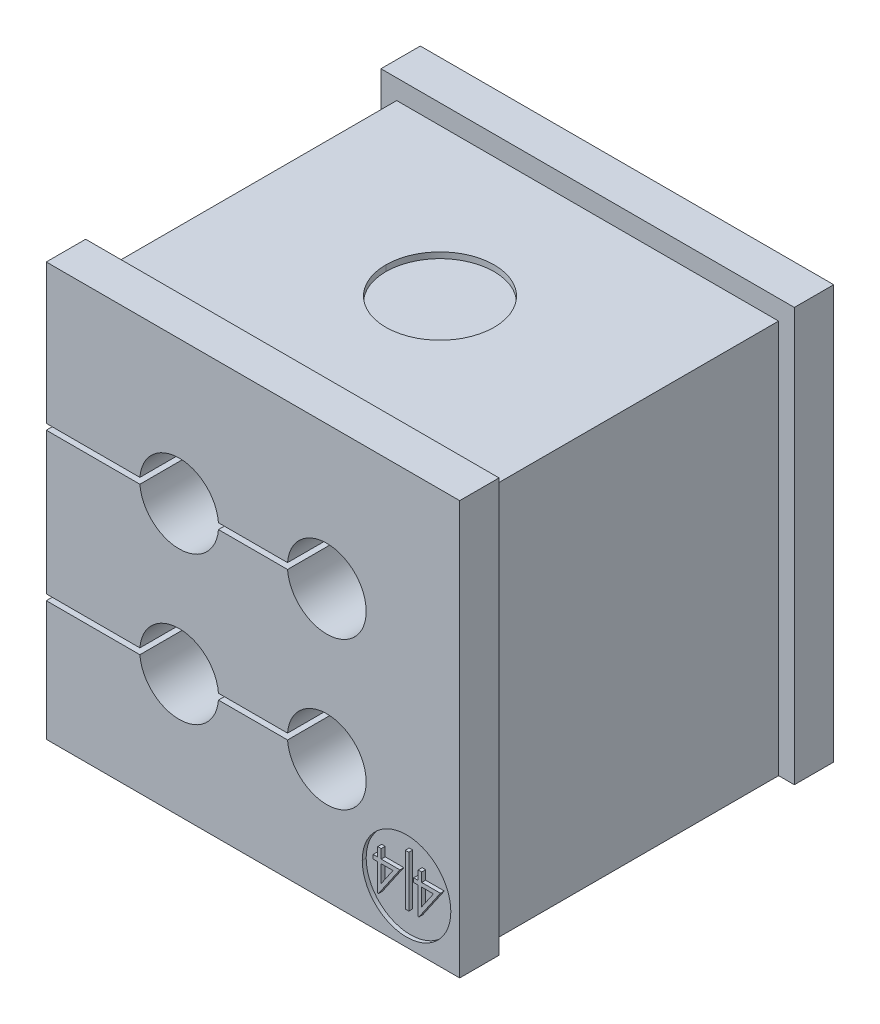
ISO-10303-21;
HEADER;
FILE_DESCRIPTION(('STEP AP214'),'2;1');
FILE_NAME('part.step','',(''),(''),'','','');
FILE_SCHEMA(('AUTOMOTIVE_DESIGN { 1 0 10303 214 1 1 1 1 }'));
ENDSEC;
DATA;
#1=APPLICATION_CONTEXT('core data for automotive mechanical design processes');
#2=APPLICATION_PROTOCOL_DEFINITION('international standard','automotive_design',2000,#1);
#3=PRODUCT_CONTEXT('',#1,'mechanical');
#4=PRODUCT('Part','Part','',(#3));
#5=PRODUCT_RELATED_PRODUCT_CATEGORY('part','',(#4));
#6=PRODUCT_DEFINITION_FORMATION('','',#4);
#7=PRODUCT_DEFINITION_CONTEXT('part definition',#1,'design');
#8=PRODUCT_DEFINITION('design','',#6,#7);
#9=PRODUCT_DEFINITION_SHAPE('','',#8);
#10=(LENGTH_UNIT() NAMED_UNIT(*) SI_UNIT(.MILLI.,.METRE.));
#11=(NAMED_UNIT(*) PLANE_ANGLE_UNIT() SI_UNIT($,.RADIAN.));
#12=(NAMED_UNIT(*) SI_UNIT($,.STERADIAN.) SOLID_ANGLE_UNIT());
#13=UNCERTAINTY_MEASURE_WITH_UNIT(LENGTH_MEASURE(1.E-05),#10,'distance_accuracy_value','');
#14=(GEOMETRIC_REPRESENTATION_CONTEXT(3) GLOBAL_UNCERTAINTY_ASSIGNED_CONTEXT((#13)) GLOBAL_UNIT_ASSIGNED_CONTEXT((#10,
#11,#12)) REPRESENTATION_CONTEXT('',''));
#15=CARTESIAN_POINT('',(0.,0.,0.));
#16=DIRECTION('',(0.,0.,1.));
#17=DIRECTION('',(1.,0.,0.));
#18=AXIS2_PLACEMENT_3D('',#15,#16,#17);
#19=CARTESIAN_POINT('',(0.,-4.1,-9.5));
#20=DIRECTION('',(0.,1.,0.));
#21=DIRECTION('',(1.,0.,0.));
#22=AXIS2_PLACEMENT_3D('',#19,#20,#21);
#23=PLANE('',#22);
#24=DIRECTION('',(0.,0.,1.));
#25=VECTOR('',#24,1.);
#26=CARTESIAN_POINT('',(0.,-4.1,-9.5));
#27=LINE('',#26,#25);
#28=CARTESIAN_POINT('',(0.,-4.1,-9.5));
#29=VERTEX_POINT('',#28);
#30=CARTESIAN_POINT('',(0.,-4.1,-7.5));
#31=VERTEX_POINT('',#30);
#32=EDGE_CURVE('E808',#29,#31,#27,.T.);
#33=ORIENTED_EDGE('',*,*,#32,.F.);
#34=DIRECTION('',(-1.,0.,0.));
#35=VECTOR('',#34,1.);
#36=CARTESIAN_POINT('',(0.,-4.1,-9.5));
#37=LINE('',#36,#35);
#38=CARTESIAN_POINT('',(4.75563293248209,-4.1,-9.5));
#39=VERTEX_POINT('',#38);
#40=EDGE_CURVE('E1135',#39,#29,#37,.T.);
#41=ORIENTED_EDGE('',*,*,#40,.F.);
#42=DIRECTION('',(0.,0.,-1.));
#43=VECTOR('',#42,1.);
#44=CARTESIAN_POINT('',(4.75563293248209,-4.1,-15.1568542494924));
#45=LINE('',#44,#43);
#46=CARTESIAN_POINT('',(4.75563293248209,-4.1,9.5));
#47=VERTEX_POINT('',#46);
#48=EDGE_CURVE('E893',#47,#39,#45,.T.);
#49=ORIENTED_EDGE('',*,*,#48,.F.);
#50=DIRECTION('',(-1.,0.,0.));
#51=VECTOR('',#50,1.);
#52=CARTESIAN_POINT('',(0.,-4.1,9.5));
#53=LINE('',#52,#51);
#54=CARTESIAN_POINT('',(0.,-4.1,9.5));
#55=VERTEX_POINT('',#54);
#56=EDGE_CURVE('E733',#47,#55,#53,.T.);
#57=ORIENTED_EDGE('',*,*,#56,.T.);
#58=DIRECTION('',(0.,0.,1.));
#59=VECTOR('',#58,1.);
#60=CARTESIAN_POINT('',(0.,-4.1,-9.5));
#61=LINE('',#60,#59);
#62=CARTESIAN_POINT('',(0.,-4.1,7.5));
#63=VERTEX_POINT('',#62);
#64=EDGE_CURVE('E784',#63,#55,#61,.T.);
#65=ORIENTED_EDGE('',*,*,#64,.F.);
#66=DIRECTION('',(-1.,0.,0.));
#67=VECTOR('',#66,1.);
#68=CARTESIAN_POINT('',(1.3,-4.1,7.5));
#69=LINE('',#68,#67);
#70=CARTESIAN_POINT('',(0.8,-4.1,7.5));
#71=VERTEX_POINT('',#70);
#72=EDGE_CURVE('E663',#71,#63,#69,.T.);
#73=ORIENTED_EDGE('',*,*,#72,.F.);
#74=DIRECTION('',(0.,0.,1.));
#75=VECTOR('',#74,1.);
#76=CARTESIAN_POINT('',(0.8,-4.1,1.75));
#77=LINE('',#76,#75);
#78=CARTESIAN_POINT('',(0.8,-4.1,-7.5));
#79=VERTEX_POINT('',#78);
#80=EDGE_CURVE('E845',#79,#71,#77,.T.);
#81=ORIENTED_EDGE('',*,*,#80,.F.);
#82=DIRECTION('',(1.,0.,0.));
#83=VECTOR('',#82,1.);
#84=CARTESIAN_POINT('',(0.,-4.1,-7.5));
#85=LINE('',#84,#83);
#86=EDGE_CURVE('E872',#31,#79,#85,.T.);
#87=ORIENTED_EDGE('',*,*,#86,.F.);
#88=EDGE_LOOP('',(#33,#41,#49,#57,#65,#73,#81,#87));
#89=FACE_BOUND('',#88,.T.);
#90=ADVANCED_FACE('F15',(#89),#23,.F.);
#91=CARTESIAN_POINT('',(0.,-4.4,-9.5));
#92=DIRECTION('',(0.,-1.,0.));
#93=DIRECTION('',(0.,0.,-1.));
#94=AXIS2_PLACEMENT_3D('',#91,#92,#93);
#95=PLANE('',#94);
#96=DIRECTION('',(0.,0.,-1.));
#97=VECTOR('',#96,1.);
#98=CARTESIAN_POINT('',(0.8,-4.4,1.75));
#99=LINE('',#98,#97);
#100=CARTESIAN_POINT('',(0.8,-4.4,7.5));
#101=VERTEX_POINT('',#100);
#102=CARTESIAN_POINT('',(0.8,-4.4,-7.5));
#103=VERTEX_POINT('',#102);
#104=EDGE_CURVE('E817',#101,#103,#99,.T.);
#105=ORIENTED_EDGE('',*,*,#104,.F.);
#106=DIRECTION('',(1.,0.,0.));
#107=VECTOR('',#106,1.);
#108=CARTESIAN_POINT('',(1.3,-4.4,7.5));
#109=LINE('',#108,#107);
#110=CARTESIAN_POINT('',(0.,-4.4,7.5));
#111=VERTEX_POINT('',#110);
#112=EDGE_CURVE('E1178',#111,#101,#109,.T.);
#113=ORIENTED_EDGE('',*,*,#112,.F.);
#114=DIRECTION('',(0.,0.,1.));
#115=VECTOR('',#114,1.);
#116=CARTESIAN_POINT('',(0.,-4.4,-9.5));
#117=LINE('',#116,#115);
#118=CARTESIAN_POINT('',(0.,-4.4,9.5));
#119=VERTEX_POINT('',#118);
#120=EDGE_CURVE('E859',#111,#119,#117,.T.);
#121=ORIENTED_EDGE('',*,*,#120,.T.);
#122=DIRECTION('',(1.,0.,0.));
#123=VECTOR('',#122,1.);
#124=CARTESIAN_POINT('',(0.,-4.4,9.5));
#125=LINE('',#124,#123);
#126=CARTESIAN_POINT('',(4.75563293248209,-4.4,9.5));
#127=VERTEX_POINT('',#126);
#128=EDGE_CURVE('E797',#119,#127,#125,.T.);
#129=ORIENTED_EDGE('',*,*,#128,.T.);
#130=DIRECTION('',(0.,0.,1.));
#131=VECTOR('',#130,1.);
#132=CARTESIAN_POINT('',(4.75563293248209,-4.4,-15.1568542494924));
#133=LINE('',#132,#131);
#134=CARTESIAN_POINT('',(4.75563293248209,-4.4,-9.5));
#135=VERTEX_POINT('',#134);
#136=EDGE_CURVE('E1196',#135,#127,#133,.T.);
#137=ORIENTED_EDGE('',*,*,#136,.F.);
#138=DIRECTION('',(1.,0.,0.));
#139=VECTOR('',#138,1.);
#140=CARTESIAN_POINT('',(0.,-4.4,-9.5));
#141=LINE('',#140,#139);
#142=CARTESIAN_POINT('',(0.,-4.4,-9.5));
#143=VERTEX_POINT('',#142);
#144=EDGE_CURVE('E1164',#143,#135,#141,.T.);
#145=ORIENTED_EDGE('',*,*,#144,.F.);
#146=DIRECTION('',(0.,0.,1.));
#147=VECTOR('',#146,1.);
#148=CARTESIAN_POINT('',(0.,-4.4,-9.5));
#149=LINE('',#148,#147);
#150=CARTESIAN_POINT('',(0.,-4.4,-7.5));
#151=VERTEX_POINT('',#150);
#152=EDGE_CURVE('E759',#143,#151,#149,.T.);
#153=ORIENTED_EDGE('',*,*,#152,.T.);
#154=DIRECTION('',(-1.,0.,0.));
#155=VECTOR('',#154,1.);
#156=CARTESIAN_POINT('',(0.,-4.4,-7.5));
#157=LINE('',#156,#155);
#158=EDGE_CURVE('E1175',#103,#151,#157,.T.);
#159=ORIENTED_EDGE('',*,*,#158,.F.);
#160=EDGE_LOOP('',(#105,#113,#121,#129,#137,#145,#153,#159));
#161=FACE_BOUND('',#160,.T.);
#162=ADVANCED_FACE('F17',(#161),#95,.F.);
#163=CARTESIAN_POINT('',(0.,-4.1,-9.5));
#164=DIRECTION('',(0.,1.,0.));
#165=DIRECTION('',(1.,0.,0.));
#166=AXIS2_PLACEMENT_3D('',#163,#164,#165);
#167=PLANE('',#166);
#168=DIRECTION('',(-1.,0.,0.));
#169=VECTOR('',#168,1.);
#170=CARTESIAN_POINT('',(0.,-4.1,-9.5));
#171=LINE('',#170,#169);
#172=CARTESIAN_POINT('',(12.2556329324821,-4.1,-9.5));
#173=VERTEX_POINT('',#172);
#174=CARTESIAN_POINT('',(8.74436706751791,-4.1,-9.5));
#175=VERTEX_POINT('',#174);
#176=EDGE_CURVE('E623',#173,#175,#171,.T.);
#177=ORIENTED_EDGE('',*,*,#176,.F.);
#178=DIRECTION('',(0.,0.,-1.));
#179=VECTOR('',#178,1.);
#180=CARTESIAN_POINT('',(12.2556329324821,-4.1,-15.1568542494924));
#181=LINE('',#180,#179);
#182=CARTESIAN_POINT('',(12.2556329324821,-4.1,9.5));
#183=VERTEX_POINT('',#182);
#184=EDGE_CURVE('E639',#183,#173,#181,.T.);
#185=ORIENTED_EDGE('',*,*,#184,.F.);
#186=DIRECTION('',(-1.,0.,0.));
#187=VECTOR('',#186,1.);
#188=CARTESIAN_POINT('',(0.,-4.1,9.5));
#189=LINE('',#188,#187);
#190=CARTESIAN_POINT('',(8.74436706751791,-4.1,9.5));
#191=VERTEX_POINT('',#190);
#192=EDGE_CURVE('E736',#183,#191,#189,.T.);
#193=ORIENTED_EDGE('',*,*,#192,.T.);
#194=DIRECTION('',(0.,0.,1.));
#195=VECTOR('',#194,1.);
#196=CARTESIAN_POINT('',(8.74436706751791,-4.1,-15.1568542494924));
#197=LINE('',#196,#195);
#198=EDGE_CURVE('E906',#175,#191,#197,.T.);
#199=ORIENTED_EDGE('',*,*,#198,.F.);
#200=EDGE_LOOP('',(#177,#185,#193,#199));
#201=FACE_BOUND('',#200,.T.);
#202=ADVANCED_FACE('F1431',(#201),#167,.F.);
#203=CARTESIAN_POINT('',(0.,-4.4,-9.5));
#204=DIRECTION('',(0.,-1.,0.));
#205=DIRECTION('',(0.,0.,-1.));
#206=AXIS2_PLACEMENT_3D('',#203,#204,#205);
#207=PLANE('',#206);
#208=DIRECTION('',(1.,0.,0.));
#209=VECTOR('',#208,1.);
#210=CARTESIAN_POINT('',(0.,-4.4,9.5));
#211=LINE('',#210,#209);
#212=CARTESIAN_POINT('',(8.74436706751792,-4.4,9.5));
#213=VERTEX_POINT('',#212);
#214=CARTESIAN_POINT('',(12.2556329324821,-4.4,9.5));
#215=VERTEX_POINT('',#214);
#216=EDGE_CURVE('E889',#213,#215,#211,.T.);
#217=ORIENTED_EDGE('',*,*,#216,.T.);
#218=DIRECTION('',(0.,0.,1.));
#219=VECTOR('',#218,1.);
#220=CARTESIAN_POINT('',(12.2556329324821,-4.4,-15.1568542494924));
#221=LINE('',#220,#219);
#222=CARTESIAN_POINT('',(12.2556329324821,-4.4,-9.5));
#223=VERTEX_POINT('',#222);
#224=EDGE_CURVE('E1199',#223,#215,#221,.T.);
#225=ORIENTED_EDGE('',*,*,#224,.F.);
#226=DIRECTION('',(1.,0.,0.));
#227=VECTOR('',#226,1.);
#228=CARTESIAN_POINT('',(0.,-4.4,-9.5));
#229=LINE('',#228,#227);
#230=CARTESIAN_POINT('',(8.74436706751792,-4.4,-9.5));
#231=VERTEX_POINT('',#230);
#232=EDGE_CURVE('E620',#231,#223,#229,.T.);
#233=ORIENTED_EDGE('',*,*,#232,.F.);
#234=DIRECTION('',(0.,0.,-1.));
#235=VECTOR('',#234,1.);
#236=CARTESIAN_POINT('',(8.74436706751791,-4.4,-15.1568542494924));
#237=LINE('',#236,#235);
#238=EDGE_CURVE('E1193',#213,#231,#237,.T.);
#239=ORIENTED_EDGE('',*,*,#238,.F.);
#240=EDGE_LOOP('',(#217,#225,#233,#239));
#241=FACE_BOUND('',#240,.T.);
#242=ADVANCED_FACE('F1559',(#241),#207,.F.);
#243=CARTESIAN_POINT('',(0.,3.4,-9.5));
#244=DIRECTION('',(0.,1.,0.));
#245=DIRECTION('',(1.,0.,0.));
#246=AXIS2_PLACEMENT_3D('',#243,#244,#245);
#247=PLANE('',#246);
#248=DIRECTION('',(0.,0.,1.));
#249=VECTOR('',#248,1.);
#250=CARTESIAN_POINT('',(0.,3.4,-9.5));
#251=LINE('',#250,#249);
#252=CARTESIAN_POINT('',(0.,3.4,-9.5));
#253=VERTEX_POINT('',#252);
#254=CARTESIAN_POINT('',(0.,3.4,-7.5));
#255=VERTEX_POINT('',#254);
#256=EDGE_CURVE('E728',#253,#255,#251,.T.);
#257=ORIENTED_EDGE('',*,*,#256,.F.);
#258=DIRECTION('',(-1.,0.,0.));
#259=VECTOR('',#258,1.);
#260=CARTESIAN_POINT('',(0.,3.4,-9.5));
#261=LINE('',#260,#259);
#262=CARTESIAN_POINT('',(4.75563293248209,3.4,-9.5));
#263=VERTEX_POINT('',#262);
#264=EDGE_CURVE('E1156',#263,#253,#261,.T.);
#265=ORIENTED_EDGE('',*,*,#264,.F.);
#266=DIRECTION('',(0.,0.,-1.));
#267=VECTOR('',#266,1.);
#268=CARTESIAN_POINT('',(4.75563293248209,3.4,-15.1568542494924));
#269=LINE('',#268,#267);
#270=CARTESIAN_POINT('',(4.75563293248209,3.4,9.5));
#271=VERTEX_POINT('',#270);
#272=EDGE_CURVE('E1007',#271,#263,#269,.T.);
#273=ORIENTED_EDGE('',*,*,#272,.F.);
#274=DIRECTION('',(-1.,0.,0.));
#275=VECTOR('',#274,1.);
#276=CARTESIAN_POINT('',(0.,3.4,9.5));
#277=LINE('',#276,#275);
#278=CARTESIAN_POINT('',(0.,3.4,9.5));
#279=VERTEX_POINT('',#278);
#280=EDGE_CURVE('E793',#271,#279,#277,.T.);
#281=ORIENTED_EDGE('',*,*,#280,.T.);
#282=DIRECTION('',(0.,0.,1.));
#283=VECTOR('',#282,1.);
#284=CARTESIAN_POINT('',(0.,3.4,-9.5));
#285=LINE('',#284,#283);
#286=CARTESIAN_POINT('',(0.,3.4,7.5));
#287=VERTEX_POINT('',#286);
#288=EDGE_CURVE('E914',#287,#279,#285,.T.);
#289=ORIENTED_EDGE('',*,*,#288,.F.);
#290=DIRECTION('',(-1.,0.,0.));
#291=VECTOR('',#290,1.);
#292=CARTESIAN_POINT('',(1.3,3.4,7.5));
#293=LINE('',#292,#291);
#294=CARTESIAN_POINT('',(0.8,3.4,7.5));
#295=VERTEX_POINT('',#294);
#296=EDGE_CURVE('E780',#295,#287,#293,.T.);
#297=ORIENTED_EDGE('',*,*,#296,.F.);
#298=DIRECTION('',(0.,0.,1.));
#299=VECTOR('',#298,1.);
#300=CARTESIAN_POINT('',(0.8,3.4,1.75));
#301=LINE('',#300,#299);
#302=CARTESIAN_POINT('',(0.8,3.4,-7.5));
#303=VERTEX_POINT('',#302);
#304=EDGE_CURVE('E955',#303,#295,#301,.T.);
#305=ORIENTED_EDGE('',*,*,#304,.F.);
#306=DIRECTION('',(1.,0.,0.));
#307=VECTOR('',#306,1.);
#308=CARTESIAN_POINT('',(0.,3.4,-7.5));
#309=LINE('',#308,#307);
#310=EDGE_CURVE('E967',#255,#303,#309,.T.);
#311=ORIENTED_EDGE('',*,*,#310,.F.);
#312=EDGE_LOOP('',(#257,#265,#273,#281,#289,#297,#305,#311));
#313=FACE_BOUND('',#312,.T.);
#314=ADVANCED_FACE('F1555',(#313),#247,.F.);
#315=CARTESIAN_POINT('',(0.,3.1,-9.5));
#316=DIRECTION('',(0.,-1.,0.));
#317=DIRECTION('',(0.,0.,-1.));
#318=AXIS2_PLACEMENT_3D('',#315,#316,#317);
#319=PLANE('',#318);
#320=DIRECTION('',(0.,0.,-1.));
#321=VECTOR('',#320,1.);
#322=CARTESIAN_POINT('',(0.8,3.1,1.75));
#323=LINE('',#322,#321);
#324=CARTESIAN_POINT('',(0.8,3.1,7.5));
#325=VERTEX_POINT('',#324);
#326=CARTESIAN_POINT('',(0.8,3.1,-7.5));
#327=VERTEX_POINT('',#326);
#328=EDGE_CURVE('E863',#325,#327,#323,.T.);
#329=ORIENTED_EDGE('',*,*,#328,.F.);
#330=DIRECTION('',(1.,0.,0.));
#331=VECTOR('',#330,1.);
#332=CARTESIAN_POINT('',(1.3,3.1,7.5));
#333=LINE('',#332,#331);
#334=CARTESIAN_POINT('',(0.,3.1,7.5));
#335=VERTEX_POINT('',#334);
#336=EDGE_CURVE('E659',#335,#325,#333,.T.);
#337=ORIENTED_EDGE('',*,*,#336,.F.);
#338=DIRECTION('',(0.,0.,1.));
#339=VECTOR('',#338,1.);
#340=CARTESIAN_POINT('',(0.,3.1,-9.5));
#341=LINE('',#340,#339);
#342=CARTESIAN_POINT('',(0.,3.1,9.5));
#343=VERTEX_POINT('',#342);
#344=EDGE_CURVE('E792',#335,#343,#341,.T.);
#345=ORIENTED_EDGE('',*,*,#344,.T.);
#346=DIRECTION('',(1.,0.,0.));
#347=VECTOR('',#346,1.);
#348=CARTESIAN_POINT('',(0.,3.1,9.5));
#349=LINE('',#348,#347);
#350=CARTESIAN_POINT('',(4.75563293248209,3.1,9.5));
#351=VERTEX_POINT('',#350);
#352=EDGE_CURVE('E1053',#343,#351,#349,.T.);
#353=ORIENTED_EDGE('',*,*,#352,.T.);
#354=DIRECTION('',(0.,0.,1.));
#355=VECTOR('',#354,1.);
#356=CARTESIAN_POINT('',(4.75563293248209,3.1,-15.1568542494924));
#357=LINE('',#356,#355);
#358=CARTESIAN_POINT('',(4.75563293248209,3.1,-9.5));
#359=VERTEX_POINT('',#358);
#360=EDGE_CURVE('E1187',#359,#351,#357,.T.);
#361=ORIENTED_EDGE('',*,*,#360,.F.);
#362=DIRECTION('',(1.,0.,0.));
#363=VECTOR('',#362,1.);
#364=CARTESIAN_POINT('',(0.,3.1,-9.5));
#365=LINE('',#364,#363);
#366=CARTESIAN_POINT('',(0.,3.1,-9.5));
#367=VERTEX_POINT('',#366);
#368=EDGE_CURVE('E1138',#367,#359,#365,.T.);
#369=ORIENTED_EDGE('',*,*,#368,.F.);
#370=DIRECTION('',(0.,0.,1.));
#371=VECTOR('',#370,1.);
#372=CARTESIAN_POINT('',(0.,3.1,-9.5));
#373=LINE('',#372,#371);
#374=CARTESIAN_POINT('',(0.,3.1,-7.5));
#375=VERTEX_POINT('',#374);
#376=EDGE_CURVE('E837',#367,#375,#373,.T.);
#377=ORIENTED_EDGE('',*,*,#376,.T.);
#378=DIRECTION('',(-1.,0.,0.));
#379=VECTOR('',#378,1.);
#380=CARTESIAN_POINT('',(0.,3.1,-7.5));
#381=LINE('',#380,#379);
#382=EDGE_CURVE('E879',#327,#375,#381,.T.);
#383=ORIENTED_EDGE('',*,*,#382,.F.);
#384=EDGE_LOOP('',(#329,#337,#345,#353,#361,#369,#377,#383));
#385=FACE_BOUND('',#384,.T.);
#386=ADVANCED_FACE('F1558',(#385),#319,.F.);
#387=CARTESIAN_POINT('',(0.,3.4,-9.5));
#388=DIRECTION('',(0.,1.,0.));
#389=DIRECTION('',(1.,0.,0.));
#390=AXIS2_PLACEMENT_3D('',#387,#388,#389);
#391=PLANE('',#390);
#392=DIRECTION('',(-1.,0.,0.));
#393=VECTOR('',#392,1.);
#394=CARTESIAN_POINT('',(0.,3.4,-9.5));
#395=LINE('',#394,#393);
#396=CARTESIAN_POINT('',(12.2556329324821,3.4,-9.5));
#397=VERTEX_POINT('',#396);
#398=CARTESIAN_POINT('',(8.74436706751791,3.4,-9.5));
#399=VERTEX_POINT('',#398);
#400=EDGE_CURVE('E1153',#397,#399,#395,.T.);
#401=ORIENTED_EDGE('',*,*,#400,.F.);
#402=DIRECTION('',(0.,0.,-1.));
#403=VECTOR('',#402,1.);
#404=CARTESIAN_POINT('',(12.2556329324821,3.4,-15.1568542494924));
#405=LINE('',#404,#403);
#406=CARTESIAN_POINT('',(12.2556329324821,3.4,9.5));
#407=VERTEX_POINT('',#406);
#408=EDGE_CURVE('E713',#407,#397,#405,.T.);
#409=ORIENTED_EDGE('',*,*,#408,.F.);
#410=DIRECTION('',(-1.,0.,0.));
#411=VECTOR('',#410,1.);
#412=CARTESIAN_POINT('',(0.,3.4,9.5));
#413=LINE('',#412,#411);
#414=CARTESIAN_POINT('',(8.74436706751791,3.4,9.5));
#415=VERTEX_POINT('',#414);
#416=EDGE_CURVE('E796',#407,#415,#413,.T.);
#417=ORIENTED_EDGE('',*,*,#416,.T.);
#418=DIRECTION('',(0.,0.,1.));
#419=VECTOR('',#418,1.);
#420=CARTESIAN_POINT('',(8.74436706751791,3.4,-15.1568542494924));
#421=LINE('',#420,#419);
#422=EDGE_CURVE('E894',#399,#415,#421,.T.);
#423=ORIENTED_EDGE('',*,*,#422,.F.);
#424=EDGE_LOOP('',(#401,#409,#417,#423));
#425=FACE_BOUND('',#424,.T.);
#426=ADVANCED_FACE('F1698',(#425),#391,.F.);
#427=CARTESIAN_POINT('',(0.,3.1,-9.5));
#428=DIRECTION('',(0.,-1.,0.));
#429=DIRECTION('',(0.,0.,-1.));
#430=AXIS2_PLACEMENT_3D('',#427,#428,#429);
#431=PLANE('',#430);
#432=DIRECTION('',(1.,0.,0.));
#433=VECTOR('',#432,1.);
#434=CARTESIAN_POINT('',(0.,3.1,9.5));
#435=LINE('',#434,#433);
#436=CARTESIAN_POINT('',(8.74436706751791,3.1,9.5));
#437=VERTEX_POINT('',#436);
#438=CARTESIAN_POINT('',(12.2556329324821,3.1,9.5));
#439=VERTEX_POINT('',#438);
#440=EDGE_CURVE('E1054',#437,#439,#435,.T.);
#441=ORIENTED_EDGE('',*,*,#440,.T.);
#442=DIRECTION('',(0.,0.,1.));
#443=VECTOR('',#442,1.);
#444=CARTESIAN_POINT('',(12.2556329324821,3.1,-15.1568542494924));
#445=LINE('',#444,#443);
#446=CARTESIAN_POINT('',(12.2556329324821,3.1,-9.5));
#447=VERTEX_POINT('',#446);
#448=EDGE_CURVE('E1190',#447,#439,#445,.T.);
#449=ORIENTED_EDGE('',*,*,#448,.F.);
#450=DIRECTION('',(1.,0.,0.));
#451=VECTOR('',#450,1.);
#452=CARTESIAN_POINT('',(0.,3.1,-9.5));
#453=LINE('',#452,#451);
#454=CARTESIAN_POINT('',(8.74436706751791,3.1,-9.5));
#455=VERTEX_POINT('',#454);
#456=EDGE_CURVE('E1146',#455,#447,#453,.T.);
#457=ORIENTED_EDGE('',*,*,#456,.F.);
#458=DIRECTION('',(0.,0.,-1.));
#459=VECTOR('',#458,1.);
#460=CARTESIAN_POINT('',(8.74436706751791,3.1,-15.1568542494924));
#461=LINE('',#460,#459);
#462=EDGE_CURVE('E1184',#437,#455,#461,.T.);
#463=ORIENTED_EDGE('',*,*,#462,.F.);
#464=EDGE_LOOP('',(#441,#449,#457,#463));
#465=FACE_BOUND('',#464,.T.);
#466=ADVANCED_FACE('F1422',(#465),#431,.F.);
#467=CARTESIAN_POINT('',(18.3,-7.8,9.3));
#468=DIRECTION('',(0.,0.,1.));
#469=DIRECTION('',(1.,0.,0.));
#470=AXIS2_PLACEMENT_3D('',#467,#468,#469);
#471=PLANE('',#470);
#472=DIRECTION('',(-1.,0.,0.));
#473=VECTOR('',#472,1.);
#474=CARTESIAN_POINT('',(17.6115384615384,-7.46666666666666,9.3));
#475=LINE('',#474,#473);
#476=CARTESIAN_POINT('',(17.6115384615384,-7.46666666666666,9.3));
#477=VERTEX_POINT('',#476);
#478=CARTESIAN_POINT('',(17.0153846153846,-7.46666666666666,9.3));
#479=VERTEX_POINT('',#478);
#480=EDGE_CURVE('E1388',#477,#479,#475,.T.);
#481=ORIENTED_EDGE('',*,*,#480,.T.);
#482=DIRECTION('',(0.,-1.,0.));
#483=VECTOR('',#482,1.);
#484=CARTESIAN_POINT('',(17.0153846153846,-7.46666666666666,9.3));
#485=LINE('',#484,#483);
#486=CARTESIAN_POINT('',(17.0153846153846,-8.33525641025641,9.3));
#487=VERTEX_POINT('',#486);
#488=EDGE_CURVE('E42',#479,#487,#485,.T.);
#489=ORIENTED_EDGE('',*,*,#488,.T.);
#490=DIRECTION('',(0.565883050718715,0.82448552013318,0.));
#491=VECTOR('',#490,1.);
#492=CARTESIAN_POINT('',(17.0153846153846,-8.33525641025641,9.3));
#493=LINE('',#492,#491);
#494=EDGE_CURVE('E9',#487,#477,#493,.T.);
#495=ORIENTED_EDGE('',*,*,#494,.T.);
#496=EDGE_LOOP('',(#481,#489,#495));
#497=FACE_BOUND('',#496,.T.);
#498=ADVANCED_FACE('F1405',(#497),#471,.T.);
#499=CARTESIAN_POINT('',(17.0153846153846,-8.33525641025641,9.5));
#500=DIRECTION('',(-0.82448552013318,0.565883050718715,0.));
#501=DIRECTION('',(0.,0.,1.));
#502=AXIS2_PLACEMENT_3D('',#499,#500,#501);
#503=PLANE('',#502);
#504=ORIENTED_EDGE('',*,*,#494,.F.);
#505=DIRECTION('',(0.,0.,-1.));
#506=VECTOR('',#505,1.);
#507=CARTESIAN_POINT('',(17.0153846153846,-8.33525641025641,9.5));
#508=LINE('',#507,#506);
#509=CARTESIAN_POINT('',(17.0153846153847,-8.33525641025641,9.5));
#510=VERTEX_POINT('',#509);
#511=EDGE_CURVE('E24',#510,#487,#508,.T.);
#512=ORIENTED_EDGE('',*,*,#511,.F.);
#513=DIRECTION('',(0.565883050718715,0.82448552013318,0.));
#514=VECTOR('',#513,1.);
#515=CARTESIAN_POINT('',(17.0153846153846,-8.33525641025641,9.5));
#516=LINE('',#515,#514);
#517=CARTESIAN_POINT('',(17.6115384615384,-7.46666666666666,9.5));
#518=VERTEX_POINT('',#517);
#519=EDGE_CURVE('E1355',#510,#518,#516,.T.);
#520=ORIENTED_EDGE('',*,*,#519,.T.);
#521=DIRECTION('',(0.,0.,-1.));
#522=VECTOR('',#521,1.);
#523=CARTESIAN_POINT('',(17.6115384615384,-7.46666666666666,9.5));
#524=LINE('',#523,#522);
#525=EDGE_CURVE('E1392',#518,#477,#524,.T.);
#526=ORIENTED_EDGE('',*,*,#525,.T.);
#527=EDGE_LOOP('',(#504,#512,#520,#526));
#528=FACE_BOUND('',#527,.T.);
#529=ADVANCED_FACE('F1413',(#528),#503,.T.);
#530=CARTESIAN_POINT('',(17.0153846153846,-7.46666666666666,9.5));
#531=DIRECTION('',(1.,0.,0.));
#532=DIRECTION('',(0.,1.,0.));
#533=AXIS2_PLACEMENT_3D('',#530,#531,#532);
#534=PLANE('',#533);
#535=ORIENTED_EDGE('',*,*,#488,.F.);
#536=DIRECTION('',(0.,0.,-1.));
#537=VECTOR('',#536,1.);
#538=CARTESIAN_POINT('',(17.0153846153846,-7.46666666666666,9.5));
#539=LINE('',#538,#537);
#540=CARTESIAN_POINT('',(17.0153846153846,-7.46666666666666,9.5));
#541=VERTEX_POINT('',#540);
#542=EDGE_CURVE('E1395',#541,#479,#539,.T.);
#543=ORIENTED_EDGE('',*,*,#542,.F.);
#544=DIRECTION('',(0.,-1.,0.));
#545=VECTOR('',#544,1.);
#546=CARTESIAN_POINT('',(17.0153846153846,-7.46666666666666,9.5));
#547=LINE('',#546,#545);
#548=EDGE_CURVE('E1359',#541,#510,#547,.T.);
#549=ORIENTED_EDGE('',*,*,#548,.T.);
#550=ORIENTED_EDGE('',*,*,#511,.T.);
#551=EDGE_LOOP('',(#535,#543,#549,#550));
#552=FACE_BOUND('',#551,.T.);
#553=ADVANCED_FACE('F1401',(#552),#534,.T.);
#554=CARTESIAN_POINT('',(17.6115384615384,-7.46666666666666,9.5));
#555=DIRECTION('',(0.,-1.,0.));
#556=DIRECTION('',(0.,0.,-1.));
#557=AXIS2_PLACEMENT_3D('',#554,#555,#556);
#558=PLANE('',#557);
#559=ORIENTED_EDGE('',*,*,#480,.F.);
#560=ORIENTED_EDGE('',*,*,#525,.F.);
#561=DIRECTION('',(-1.,0.,0.));
#562=VECTOR('',#561,1.);
#563=CARTESIAN_POINT('',(17.6115384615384,-7.46666666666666,9.5));
#564=LINE('',#563,#562);
#565=EDGE_CURVE('E1351',#518,#541,#564,.T.);
#566=ORIENTED_EDGE('',*,*,#565,.T.);
#567=ORIENTED_EDGE('',*,*,#542,.T.);
#568=EDGE_LOOP('',(#559,#560,#566,#567));
#569=FACE_BOUND('',#568,.T.);
#570=ADVANCED_FACE('F1408',(#569),#558,.T.);
#571=CARTESIAN_POINT('',(16.8723557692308,-8.85128205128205,9.5));
#572=DIRECTION('',(0.,-1.,0.));
#573=DIRECTION('',(0.,0.,-1.));
#574=AXIS2_PLACEMENT_3D('',#571,#572,#573);
#575=PLANE('',#574);
#576=DIRECTION('',(-1.,0.,0.));
#577=VECTOR('',#576,1.);
#578=CARTESIAN_POINT('',(16.8723557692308,-8.85128205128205,9.3));
#579=LINE('',#578,#577);
#580=CARTESIAN_POINT('',(16.8723557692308,-8.85128205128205,9.3));
#581=VERTEX_POINT('',#580);
#582=CARTESIAN_POINT('',(16.8358974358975,-8.85128205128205,9.3));
#583=VERTEX_POINT('',#582);
#584=EDGE_CURVE('E670',#581,#583,#579,.T.);
#585=ORIENTED_EDGE('',*,*,#584,.F.);
#586=DIRECTION('',(0.,0.,-1.));
#587=VECTOR('',#586,1.);
#588=CARTESIAN_POINT('',(16.8723557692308,-8.85128205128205,9.5));
#589=LINE('',#588,#587);
#590=CARTESIAN_POINT('',(16.8723557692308,-8.85128205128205,9.5));
#591=VERTEX_POINT('',#590);
#592=EDGE_CURVE('E1161',#591,#581,#589,.T.);
#593=ORIENTED_EDGE('',*,*,#592,.F.);
#594=DIRECTION('',(-1.,0.,0.));
#595=VECTOR('',#594,1.);
#596=CARTESIAN_POINT('',(16.8723557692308,-8.85128205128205,9.5));
#597=LINE('',#596,#595);
#598=CARTESIAN_POINT('',(16.8358974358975,-8.85128205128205,9.5));
#599=VERTEX_POINT('',#598);
#600=EDGE_CURVE('E1347',#591,#599,#597,.T.);
#601=ORIENTED_EDGE('',*,*,#600,.T.);
#602=DIRECTION('',(0.,0.,-1.));
#603=VECTOR('',#602,1.);
#604=CARTESIAN_POINT('',(16.8358974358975,-8.85128205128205,9.5));
#605=LINE('',#604,#603);
#606=EDGE_CURVE('E1385',#599,#583,#605,.T.);
#607=ORIENTED_EDGE('',*,*,#606,.T.);
#608=EDGE_LOOP('',(#585,#593,#601,#607));
#609=FACE_BOUND('',#608,.T.);
#610=ADVANCED_FACE('F1455',(#609),#575,.T.);
#611=CARTESIAN_POINT('',(16.8358974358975,-8.85128205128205,9.5));
#612=DIRECTION('',(-1.,0.,0.));
#613=DIRECTION('',(0.,0.,1.));
#614=AXIS2_PLACEMENT_3D('',#611,#612,#613);
#615=PLANE('',#614);
#616=DIRECTION('',(0.,1.,0.));
#617=VECTOR('',#616,1.);
#618=CARTESIAN_POINT('',(16.8358974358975,-8.85128205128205,9.3));
#619=LINE('',#618,#617);
#620=CARTESIAN_POINT('',(16.8358974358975,-7.46666666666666,9.3));
#621=VERTEX_POINT('',#620);
#622=EDGE_CURVE('E915',#583,#621,#619,.T.);
#623=ORIENTED_EDGE('',*,*,#622,.F.);
#624=ORIENTED_EDGE('',*,*,#606,.F.);
#625=DIRECTION('',(0.,1.,0.));
#626=VECTOR('',#625,1.);
#627=CARTESIAN_POINT('',(16.8358974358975,-8.85128205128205,9.5));
#628=LINE('',#627,#626);
#629=CARTESIAN_POINT('',(16.8358974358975,-7.46666666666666,9.5));
#630=VERTEX_POINT('',#629);
#631=EDGE_CURVE('E1343',#599,#630,#628,.T.);
#632=ORIENTED_EDGE('',*,*,#631,.T.);
#633=DIRECTION('',(0.,0.,-1.));
#634=VECTOR('',#633,1.);
#635=CARTESIAN_POINT('',(16.8358974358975,-7.46666666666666,9.5));
#636=LINE('',#635,#634);
#637=EDGE_CURVE('E1382',#630,#621,#636,.T.);
#638=ORIENTED_EDGE('',*,*,#637,.T.);
#639=EDGE_LOOP('',(#623,#624,#632,#638));
#640=FACE_BOUND('',#639,.T.);
#641=ADVANCED_FACE('F1468',(#640),#615,.T.);
#642=CARTESIAN_POINT('',(16.8358974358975,-7.46666666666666,9.5));
#643=DIRECTION('',(0.,-1.,0.));
#644=DIRECTION('',(0.,0.,-1.));
#645=AXIS2_PLACEMENT_3D('',#642,#643,#644);
#646=PLANE('',#645);
#647=DIRECTION('',(-1.,0.,0.));
#648=VECTOR('',#647,1.);
#649=CARTESIAN_POINT('',(16.8358974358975,-7.46666666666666,9.3));
#650=LINE('',#649,#648);
#651=CARTESIAN_POINT('',(16.6051282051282,-7.46666666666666,9.3));
#652=VERTEX_POINT('',#651);
#653=EDGE_CURVE('E919',#621,#652,#650,.T.);
#654=ORIENTED_EDGE('',*,*,#653,.F.);
#655=ORIENTED_EDGE('',*,*,#637,.F.);
#656=DIRECTION('',(-1.,0.,0.));
#657=VECTOR('',#656,1.);
#658=CARTESIAN_POINT('',(16.8358974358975,-7.46666666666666,9.5));
#659=LINE('',#658,#657);
#660=CARTESIAN_POINT('',(16.6051282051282,-7.46666666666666,9.5));
#661=VERTEX_POINT('',#660);
#662=EDGE_CURVE('E1339',#630,#661,#659,.T.);
#663=ORIENTED_EDGE('',*,*,#662,.T.);
#664=DIRECTION('',(0.,0.,-1.));
#665=VECTOR('',#664,1.);
#666=CARTESIAN_POINT('',(16.6051282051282,-7.46666666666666,9.5));
#667=LINE('',#666,#665);
#668=EDGE_CURVE('E1379',#661,#652,#667,.T.);
#669=ORIENTED_EDGE('',*,*,#668,.T.);
#670=EDGE_LOOP('',(#654,#655,#663,#669));
#671=FACE_BOUND('',#670,.T.);
#672=ADVANCED_FACE('F1620',(#671),#646,.T.);
#673=CARTESIAN_POINT('',(16.6051282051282,-7.46666666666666,9.5));
#674=DIRECTION('',(-1.,0.,0.));
#675=DIRECTION('',(0.,0.,1.));
#676=AXIS2_PLACEMENT_3D('',#673,#674,#675);
#677=PLANE('',#676);
#678=DIRECTION('',(0.,1.,0.));
#679=VECTOR('',#678,1.);
#680=CARTESIAN_POINT('',(16.6051282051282,-7.46666666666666,9.3));
#681=LINE('',#680,#679);
#682=CARTESIAN_POINT('',(16.6051282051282,-7.26153846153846,9.3));
#683=VERTEX_POINT('',#682);
#684=EDGE_CURVE('E924',#652,#683,#681,.T.);
#685=ORIENTED_EDGE('',*,*,#684,.F.);
#686=ORIENTED_EDGE('',*,*,#668,.F.);
#687=DIRECTION('',(0.,1.,0.));
#688=VECTOR('',#687,1.);
#689=CARTESIAN_POINT('',(16.6051282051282,-7.46666666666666,9.5));
#690=LINE('',#689,#688);
#691=CARTESIAN_POINT('',(16.6051282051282,-7.26153846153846,9.5));
#692=VERTEX_POINT('',#691);
#693=EDGE_CURVE('E1335',#661,#692,#690,.T.);
#694=ORIENTED_EDGE('',*,*,#693,.T.);
#695=DIRECTION('',(0.,0.,-1.));
#696=VECTOR('',#695,1.);
#697=CARTESIAN_POINT('',(16.6051282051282,-7.26153846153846,9.5));
#698=LINE('',#697,#696);
#699=EDGE_CURVE('E1376',#692,#683,#698,.T.);
#700=ORIENTED_EDGE('',*,*,#699,.T.);
#701=EDGE_LOOP('',(#685,#686,#694,#700));
#702=FACE_BOUND('',#701,.T.);
#703=ADVANCED_FACE('F1612',(#702),#677,.T.);
#704=CARTESIAN_POINT('',(16.6051282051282,-7.26153846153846,9.5));
#705=DIRECTION('',(0.,1.,0.));
#706=DIRECTION('',(1.,0.,0.));
#707=AXIS2_PLACEMENT_3D('',#704,#705,#706);
#708=PLANE('',#707);
#709=DIRECTION('',(1.,0.,0.));
#710=VECTOR('',#709,1.);
#711=CARTESIAN_POINT('',(16.6051282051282,-7.26153846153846,9.3));
#712=LINE('',#711,#710);
#713=CARTESIAN_POINT('',(16.8358974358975,-7.26153846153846,9.3));
#714=VERTEX_POINT('',#713);
#715=EDGE_CURVE('E928',#683,#714,#712,.T.);
#716=ORIENTED_EDGE('',*,*,#715,.F.);
#717=ORIENTED_EDGE('',*,*,#699,.F.);
#718=DIRECTION('',(1.,0.,0.));
#719=VECTOR('',#718,1.);
#720=CARTESIAN_POINT('',(16.6051282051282,-7.26153846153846,9.5));
#721=LINE('',#720,#719);
#722=CARTESIAN_POINT('',(16.8358974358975,-7.26153846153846,9.5));
#723=VERTEX_POINT('',#722);
#724=EDGE_CURVE('E1331',#692,#723,#721,.T.);
#725=ORIENTED_EDGE('',*,*,#724,.T.);
#726=DIRECTION('',(0.,0.,-1.));
#727=VECTOR('',#726,1.);
#728=CARTESIAN_POINT('',(16.8358974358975,-7.26153846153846,9.5));
#729=LINE('',#728,#727);
#730=EDGE_CURVE('E1373',#723,#714,#729,.T.);
#731=ORIENTED_EDGE('',*,*,#730,.T.);
#732=EDGE_LOOP('',(#716,#717,#725,#731));
#733=FACE_BOUND('',#732,.T.);
#734=ADVANCED_FACE('F1608',(#733),#708,.T.);
#735=CARTESIAN_POINT('',(16.8358974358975,-7.26153846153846,9.5));
#736=DIRECTION('',(-1.,0.,0.));
#737=DIRECTION('',(0.,0.,1.));
#738=AXIS2_PLACEMENT_3D('',#735,#736,#737);
#739=PLANE('',#738);
#740=DIRECTION('',(0.,1.,0.));
#741=VECTOR('',#740,1.);
#742=CARTESIAN_POINT('',(16.8358974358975,-7.26153846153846,9.3));
#743=LINE('',#742,#741);
#744=CARTESIAN_POINT('',(16.8358974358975,-6.8,9.3));
#745=VERTEX_POINT('',#744);
#746=EDGE_CURVE('E1035',#714,#745,#743,.T.);
#747=ORIENTED_EDGE('',*,*,#746,.F.);
#748=ORIENTED_EDGE('',*,*,#730,.F.);
#749=DIRECTION('',(0.,1.,0.));
#750=VECTOR('',#749,1.);
#751=CARTESIAN_POINT('',(16.8358974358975,-7.26153846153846,9.5));
#752=LINE('',#751,#750);
#753=CARTESIAN_POINT('',(16.8358974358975,-6.8,9.5));
#754=VERTEX_POINT('',#753);
#755=EDGE_CURVE('E832',#723,#754,#752,.T.);
#756=ORIENTED_EDGE('',*,*,#755,.T.);
#757=DIRECTION('',(0.,0.,-1.));
#758=VECTOR('',#757,1.);
#759=CARTESIAN_POINT('',(16.8358974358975,-6.8,9.5));
#760=LINE('',#759,#758);
#761=EDGE_CURVE('E1370',#754,#745,#760,.T.);
#762=ORIENTED_EDGE('',*,*,#761,.T.);
#763=EDGE_LOOP('',(#747,#748,#756,#762));
#764=FACE_BOUND('',#763,.T.);
#765=ADVANCED_FACE('F1611',(#764),#739,.T.);
#766=CARTESIAN_POINT('',(16.8358974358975,-6.8,9.5));
#767=DIRECTION('',(0.,1.,0.));
#768=DIRECTION('',(1.,0.,0.));
#769=AXIS2_PLACEMENT_3D('',#766,#767,#768);
#770=PLANE('',#769);
#771=DIRECTION('',(1.,0.,0.));
#772=VECTOR('',#771,1.);
#773=CARTESIAN_POINT('',(16.8358974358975,-6.8,9.3));
#774=LINE('',#773,#772);
#775=CARTESIAN_POINT('',(17.0153846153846,-6.8,9.3));
#776=VERTEX_POINT('',#775);
#777=EDGE_CURVE('E851',#745,#776,#774,.T.);
#778=ORIENTED_EDGE('',*,*,#777,.F.);
#779=ORIENTED_EDGE('',*,*,#761,.F.);
#780=DIRECTION('',(1.,0.,0.));
#781=VECTOR('',#780,1.);
#782=CARTESIAN_POINT('',(16.8358974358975,-6.8,9.5));
#783=LINE('',#782,#781);
#784=CARTESIAN_POINT('',(17.0153846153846,-6.8,9.5));
#785=VERTEX_POINT('',#784);
#786=EDGE_CURVE('E828',#754,#785,#783,.T.);
#787=ORIENTED_EDGE('',*,*,#786,.T.);
#788=DIRECTION('',(0.,0.,-1.));
#789=VECTOR('',#788,1.);
#790=CARTESIAN_POINT('',(17.0153846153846,-6.8,9.5));
#791=LINE('',#790,#789);
#792=EDGE_CURVE('E1160',#785,#776,#791,.T.);
#793=ORIENTED_EDGE('',*,*,#792,.T.);
#794=EDGE_LOOP('',(#778,#779,#787,#793));
#795=FACE_BOUND('',#794,.T.);
#796=ADVANCED_FACE('F1644',(#795),#770,.T.);
#797=CARTESIAN_POINT('',(17.0153846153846,-6.8,9.5));
#798=DIRECTION('',(1.,0.,0.));
#799=DIRECTION('',(0.,1.,0.));
#800=AXIS2_PLACEMENT_3D('',#797,#798,#799);
#801=PLANE('',#800);
#802=DIRECTION('',(0.,-1.,0.));
#803=VECTOR('',#802,1.);
#804=CARTESIAN_POINT('',(17.0153846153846,-6.8,9.3));
#805=LINE('',#804,#803);
#806=CARTESIAN_POINT('',(17.0153846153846,-7.26153846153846,9.3));
#807=VERTEX_POINT('',#806);
#808=EDGE_CURVE('E846',#776,#807,#805,.T.);
#809=ORIENTED_EDGE('',*,*,#808,.F.);
#810=ORIENTED_EDGE('',*,*,#792,.F.);
#811=DIRECTION('',(0.,-1.,0.));
#812=VECTOR('',#811,1.);
#813=CARTESIAN_POINT('',(17.0153846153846,-6.8,9.5));
#814=LINE('',#813,#812);
#815=CARTESIAN_POINT('',(17.0153846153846,-7.26153846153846,9.5));
#816=VERTEX_POINT('',#815);
#817=EDGE_CURVE('E833',#785,#816,#814,.T.);
#818=ORIENTED_EDGE('',*,*,#817,.T.);
#819=DIRECTION('',(0.,0.,-1.));
#820=VECTOR('',#819,1.);
#821=CARTESIAN_POINT('',(17.0153846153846,-7.26153846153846,9.5));
#822=LINE('',#821,#820);
#823=EDGE_CURVE('E1157',#816,#807,#822,.T.);
#824=ORIENTED_EDGE('',*,*,#823,.T.);
#825=EDGE_LOOP('',(#809,#810,#818,#824));
#826=FACE_BOUND('',#825,.T.);
#827=ADVANCED_FACE('F1640',(#826),#801,.T.);
#828=CARTESIAN_POINT('',(17.0153846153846,-7.26153846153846,9.5));
#829=DIRECTION('',(0.,1.,0.));
#830=DIRECTION('',(1.,0.,0.));
#831=AXIS2_PLACEMENT_3D('',#828,#829,#830);
#832=PLANE('',#831);
#833=DIRECTION('',(1.,0.,0.));
#834=VECTOR('',#833,1.);
#835=CARTESIAN_POINT('',(17.0153846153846,-7.26153846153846,9.3));
#836=LINE('',#835,#834);
#837=CARTESIAN_POINT('',(17.9641025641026,-7.26153846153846,9.3));
#838=VERTEX_POINT('',#837);
#839=EDGE_CURVE('E850',#807,#838,#836,.T.);
#840=ORIENTED_EDGE('',*,*,#839,.F.);
#841=ORIENTED_EDGE('',*,*,#823,.F.);
#842=DIRECTION('',(1.,0.,0.));
#843=VECTOR('',#842,1.);
#844=CARTESIAN_POINT('',(17.0153846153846,-7.26153846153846,9.5));
#845=LINE('',#844,#843);
#846=CARTESIAN_POINT('',(17.9641025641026,-7.26153846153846,9.5));
#847=VERTEX_POINT('',#846);
#848=EDGE_CURVE('E1321',#816,#847,#845,.T.);
#849=ORIENTED_EDGE('',*,*,#848,.T.);
#850=DIRECTION('',(0.,0.,-1.));
#851=VECTOR('',#850,1.);
#852=CARTESIAN_POINT('',(17.9641025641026,-7.26153846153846,9.5));
#853=LINE('',#852,#851);
#854=EDGE_CURVE('E1363',#847,#838,#853,.T.);
#855=ORIENTED_EDGE('',*,*,#854,.T.);
#856=EDGE_LOOP('',(#840,#841,#849,#855));
#857=FACE_BOUND('',#856,.T.);
#858=ADVANCED_FACE('F1636',(#857),#832,.T.);
#859=CARTESIAN_POINT('',(17.9641025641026,-7.26153846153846,9.5));
#860=DIRECTION('',(0.824332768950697,-0.566105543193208,0.));
#861=DIRECTION('',(0.,0.,-1.));
#862=AXIS2_PLACEMENT_3D('',#859,#860,#861);
#863=PLANE('',#862);
#864=DIRECTION('',(-0.566105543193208,-0.824332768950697,0.));
#865=VECTOR('',#864,1.);
#866=CARTESIAN_POINT('',(17.9641025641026,-7.26153846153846,9.3));
#867=LINE('',#866,#865);
#868=EDGE_CURVE('E666',#838,#581,#867,.T.);
#869=ORIENTED_EDGE('',*,*,#868,.F.);
#870=ORIENTED_EDGE('',*,*,#854,.F.);
#871=DIRECTION('',(-0.566105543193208,-0.824332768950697,0.));
#872=VECTOR('',#871,1.);
#873=CARTESIAN_POINT('',(17.9641025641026,-7.26153846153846,9.5));
#874=LINE('',#873,#872);
#875=EDGE_CURVE('E645',#847,#591,#874,.T.);
#876=ORIENTED_EDGE('',*,*,#875,.T.);
#877=ORIENTED_EDGE('',*,*,#592,.T.);
#878=EDGE_LOOP('',(#869,#870,#876,#877));
#879=FACE_BOUND('',#878,.T.);
#880=ADVANCED_FACE('F1492',(#879),#863,.T.);
#881=CARTESIAN_POINT('',(0.,0.,9.5));
#882=DIRECTION('',(0.,0.,-1.));
#883=DIRECTION('',(0.,-1.,0.));
#884=AXIS2_PLACEMENT_3D('',#881,#882,#883);
#885=PLANE('',#884);
#886=ORIENTED_EDGE('',*,*,#565,.F.);
#887=ORIENTED_EDGE('',*,*,#519,.F.);
#888=ORIENTED_EDGE('',*,*,#548,.F.);
#889=EDGE_LOOP('',(#886,#887,#888));
#890=FACE_BOUND('',#889,.T.);
#891=ORIENTED_EDGE('',*,*,#875,.F.);
#892=ORIENTED_EDGE('',*,*,#848,.F.);
#893=ORIENTED_EDGE('',*,*,#817,.F.);
#894=ORIENTED_EDGE('',*,*,#786,.F.);
#895=ORIENTED_EDGE('',*,*,#755,.F.);
#896=ORIENTED_EDGE('',*,*,#724,.F.);
#897=ORIENTED_EDGE('',*,*,#693,.F.);
#898=ORIENTED_EDGE('',*,*,#662,.F.);
#899=ORIENTED_EDGE('',*,*,#631,.F.);
#900=ORIENTED_EDGE('',*,*,#600,.F.);
#901=EDGE_LOOP('',(#891,#892,#893,#894,#895,#896,#897,#898,#899,#900));
#902=FACE_BOUND('',#901,.T.);
#903=ADVANCED_FACE('F1411',(#890,#902),#885,.F.);
#904=CARTESIAN_POINT('',(0.,0.,9.5));
#905=DIRECTION('',(0.,0.,-1.));
#906=DIRECTION('',(0.,-1.,0.));
#907=AXIS2_PLACEMENT_3D('',#904,#905,#906);
#908=PLANE('',#907);
#909=DIRECTION('',(0.,-1.,0.));
#910=VECTOR('',#909,1.);
#911=CARTESIAN_POINT('',(18.4153846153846,-6.26153846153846,9.5));
#912=LINE('',#911,#910);
#913=CARTESIAN_POINT('',(18.4153846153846,-6.26153846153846,9.5));
#914=VERTEX_POINT('',#913);
#915=CARTESIAN_POINT('',(18.4153846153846,-8.85128205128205,9.5));
#916=VERTEX_POINT('',#915);
#917=EDGE_CURVE('E1299',#914,#916,#912,.T.);
#918=ORIENTED_EDGE('',*,*,#917,.F.);
#919=DIRECTION('',(1.,0.,0.));
#920=VECTOR('',#919,1.);
#921=CARTESIAN_POINT('',(18.2358974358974,-6.26153846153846,9.5));
#922=LINE('',#921,#920);
#923=CARTESIAN_POINT('',(18.2358974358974,-6.26153846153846,9.5));
#924=VERTEX_POINT('',#923);
#925=EDGE_CURVE('E1309',#924,#914,#922,.T.);
#926=ORIENTED_EDGE('',*,*,#925,.F.);
#927=DIRECTION('',(0.,1.,0.));
#928=VECTOR('',#927,1.);
#929=CARTESIAN_POINT('',(18.2358974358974,-8.85128205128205,9.5));
#930=LINE('',#929,#928);
#931=CARTESIAN_POINT('',(18.2358974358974,-8.85128205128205,9.5));
#932=VERTEX_POINT('',#931);
#933=EDGE_CURVE('E1315',#932,#924,#930,.T.);
#934=ORIENTED_EDGE('',*,*,#933,.F.);
#935=DIRECTION('',(-1.,0.,0.));
#936=VECTOR('',#935,1.);
#937=CARTESIAN_POINT('',(18.4153846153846,-8.85128205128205,9.5));
#938=LINE('',#937,#936);
#939=EDGE_CURVE('E1318',#916,#932,#938,.T.);
#940=ORIENTED_EDGE('',*,*,#939,.F.);
#941=EDGE_LOOP('',(#918,#926,#934,#940));
#942=FACE_BOUND('',#941,.T.);
#943=ADVANCED_FACE('F1491',(#942),#908,.F.);
#944=CARTESIAN_POINT('',(18.4153846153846,-8.85128205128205,9.5));
#945=DIRECTION('',(0.,-1.,0.));
#946=DIRECTION('',(0.,0.,-1.));
#947=AXIS2_PLACEMENT_3D('',#944,#945,#946);
#948=PLANE('',#947);
#949=DIRECTION('',(-1.,0.,0.));
#950=VECTOR('',#949,1.);
#951=CARTESIAN_POINT('',(18.4153846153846,-8.85128205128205,9.3));
#952=LINE('',#951,#950);
#953=CARTESIAN_POINT('',(18.4153846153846,-8.85128205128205,9.3));
#954=VERTEX_POINT('',#953);
#955=CARTESIAN_POINT('',(18.2358974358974,-8.85128205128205,9.3));
#956=VERTEX_POINT('',#955);
#957=EDGE_CURVE('E824',#954,#956,#952,.T.);
#958=ORIENTED_EDGE('',*,*,#957,.F.);
#959=DIRECTION('',(0.,0.,-1.));
#960=VECTOR('',#959,1.);
#961=CARTESIAN_POINT('',(18.4153846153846,-8.85128205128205,9.5));
#962=LINE('',#961,#960);
#963=EDGE_CURVE('E1303',#916,#954,#962,.T.);
#964=ORIENTED_EDGE('',*,*,#963,.F.);
#965=ORIENTED_EDGE('',*,*,#939,.T.);
#966=DIRECTION('',(0.,0.,-1.));
#967=VECTOR('',#966,1.);
#968=CARTESIAN_POINT('',(18.2358974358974,-8.85128205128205,9.5));
#969=LINE('',#968,#967);
#970=EDGE_CURVE('E1312',#932,#956,#969,.T.);
#971=ORIENTED_EDGE('',*,*,#970,.T.);
#972=EDGE_LOOP('',(#958,#964,#965,#971));
#973=FACE_BOUND('',#972,.T.);
#974=ADVANCED_FACE('F1578',(#973),#948,.T.);
#975=CARTESIAN_POINT('',(18.2358974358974,-8.85128205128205,9.5));
#976=DIRECTION('',(-1.,0.,0.));
#977=DIRECTION('',(0.,0.,1.));
#978=AXIS2_PLACEMENT_3D('',#975,#976,#977);
#979=PLANE('',#978);
#980=DIRECTION('',(0.,1.,0.));
#981=VECTOR('',#980,1.);
#982=CARTESIAN_POINT('',(18.2358974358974,-8.85128205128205,9.3));
#983=LINE('',#982,#981);
#984=CARTESIAN_POINT('',(18.2358974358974,-6.26153846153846,9.3));
#985=VERTEX_POINT('',#984);
#986=EDGE_CURVE('E876',#956,#985,#983,.T.);
#987=ORIENTED_EDGE('',*,*,#986,.F.);
#988=ORIENTED_EDGE('',*,*,#970,.F.);
#989=ORIENTED_EDGE('',*,*,#933,.T.);
#990=DIRECTION('',(0.,0.,-1.));
#991=VECTOR('',#990,1.);
#992=CARTESIAN_POINT('',(18.2358974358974,-6.26153846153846,9.5));
#993=LINE('',#992,#991);
#994=EDGE_CURVE('E1306',#924,#985,#993,.T.);
#995=ORIENTED_EDGE('',*,*,#994,.T.);
#996=EDGE_LOOP('',(#987,#988,#989,#995));
#997=FACE_BOUND('',#996,.T.);
#998=ADVANCED_FACE('F1474',(#997),#979,.T.);
#999=CARTESIAN_POINT('',(18.2358974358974,-6.26153846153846,9.5));
#1000=DIRECTION('',(0.,1.,0.));
#1001=DIRECTION('',(1.,0.,0.));
#1002=AXIS2_PLACEMENT_3D('',#999,#1000,#1001);
#1003=PLANE('',#1002);
#1004=DIRECTION('',(1.,0.,0.));
#1005=VECTOR('',#1004,1.);
#1006=CARTESIAN_POINT('',(18.2358974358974,-6.26153846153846,9.3));
#1007=LINE('',#1006,#1005);
#1008=CARTESIAN_POINT('',(18.4153846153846,-6.26153846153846,9.3));
#1009=VERTEX_POINT('',#1008);
#1010=EDGE_CURVE('E652',#985,#1009,#1007,.T.);
#1011=ORIENTED_EDGE('',*,*,#1010,.F.);
#1012=ORIENTED_EDGE('',*,*,#994,.F.);
#1013=ORIENTED_EDGE('',*,*,#925,.T.);
#1014=DIRECTION('',(0.,0.,-1.));
#1015=VECTOR('',#1014,1.);
#1016=CARTESIAN_POINT('',(18.4153846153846,-6.26153846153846,9.5));
#1017=LINE('',#1016,#1015);
#1018=EDGE_CURVE('E750',#914,#1009,#1017,.T.);
#1019=ORIENTED_EDGE('',*,*,#1018,.T.);
#1020=EDGE_LOOP('',(#1011,#1012,#1013,#1019));
#1021=FACE_BOUND('',#1020,.T.);
#1022=ADVANCED_FACE('F1470',(#1021),#1003,.T.);
#1023=CARTESIAN_POINT('',(18.4153846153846,-6.26153846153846,9.5));
#1024=DIRECTION('',(1.,0.,0.));
#1025=DIRECTION('',(0.,1.,0.));
#1026=AXIS2_PLACEMENT_3D('',#1023,#1024,#1025);
#1027=PLANE('',#1026);
#1028=DIRECTION('',(0.,-1.,0.));
#1029=VECTOR('',#1028,1.);
#1030=CARTESIAN_POINT('',(18.4153846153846,-6.26153846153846,9.3));
#1031=LINE('',#1030,#1029);
#1032=EDGE_CURVE('E687',#1009,#954,#1031,.T.);
#1033=ORIENTED_EDGE('',*,*,#1032,.F.);
#1034=ORIENTED_EDGE('',*,*,#1018,.F.);
#1035=ORIENTED_EDGE('',*,*,#917,.T.);
#1036=ORIENTED_EDGE('',*,*,#963,.T.);
#1037=EDGE_LOOP('',(#1033,#1034,#1035,#1036));
#1038=FACE_BOUND('',#1037,.T.);
#1039=ADVANCED_FACE('F1473',(#1038),#1027,.T.);
#1040=CARTESIAN_POINT('',(18.3,-7.8,9.3));
#1041=DIRECTION('',(0.,0.,1.));
#1042=DIRECTION('',(1.,0.,0.));
#1043=AXIS2_PLACEMENT_3D('',#1040,#1041,#1042);
#1044=PLANE('',#1043);
#1045=DIRECTION('',(-1.,0.,0.));
#1046=VECTOR('',#1045,1.);
#1047=CARTESIAN_POINT('',(19.6679487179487,-7.46666666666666,9.3));
#1048=LINE('',#1047,#1046);
#1049=CARTESIAN_POINT('',(19.6679487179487,-7.46666666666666,9.3));
#1050=VERTEX_POINT('',#1049);
#1051=CARTESIAN_POINT('',(19.0717948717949,-7.46666666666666,9.3));
#1052=VERTEX_POINT('',#1051);
#1053=EDGE_CURVE('E1278',#1050,#1052,#1048,.T.);
#1054=ORIENTED_EDGE('',*,*,#1053,.T.);
#1055=DIRECTION('',(0.,-1.,0.));
#1056=VECTOR('',#1055,1.);
#1057=CARTESIAN_POINT('',(19.0717948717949,-7.46666666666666,9.3));
#1058=LINE('',#1057,#1056);
#1059=CARTESIAN_POINT('',(19.0717948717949,-8.33525641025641,9.3));
#1060=VERTEX_POINT('',#1059);
#1061=EDGE_CURVE('E1290',#1052,#1060,#1058,.T.);
#1062=ORIENTED_EDGE('',*,*,#1061,.T.);
#1063=DIRECTION('',(0.565883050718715,0.82448552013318,0.));
#1064=VECTOR('',#1063,1.);
#1065=CARTESIAN_POINT('',(19.0717948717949,-8.33525641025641,9.3));
#1066=LINE('',#1065,#1064);
#1067=EDGE_CURVE('E747',#1060,#1050,#1066,.T.);
#1068=ORIENTED_EDGE('',*,*,#1067,.T.);
#1069=EDGE_LOOP('',(#1054,#1062,#1068));
#1070=FACE_BOUND('',#1069,.T.);
#1071=ADVANCED_FACE('F1616',(#1070),#1044,.T.);
#1072=CARTESIAN_POINT('',(19.0717948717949,-8.33525641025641,9.5));
#1073=DIRECTION('',(-0.82448552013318,0.565883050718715,0.));
#1074=DIRECTION('',(0.,0.,1.));
#1075=AXIS2_PLACEMENT_3D('',#1072,#1073,#1074);
#1076=PLANE('',#1075);
#1077=ORIENTED_EDGE('',*,*,#1067,.F.);
#1078=DIRECTION('',(0.,0.,-1.));
#1079=VECTOR('',#1078,1.);
#1080=CARTESIAN_POINT('',(19.0717948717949,-8.33525641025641,9.5));
#1081=LINE('',#1080,#1079);
#1082=CARTESIAN_POINT('',(19.0717948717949,-8.33525641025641,9.5));
#1083=VERTEX_POINT('',#1082);
#1084=EDGE_CURVE('E751',#1083,#1060,#1081,.T.);
#1085=ORIENTED_EDGE('',*,*,#1084,.F.);
#1086=DIRECTION('',(0.565883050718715,0.82448552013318,0.));
#1087=VECTOR('',#1086,1.);
#1088=CARTESIAN_POINT('',(19.0717948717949,-8.33525641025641,9.5));
#1089=LINE('',#1088,#1087);
#1090=CARTESIAN_POINT('',(19.6679487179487,-7.46666666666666,9.5));
#1091=VERTEX_POINT('',#1090);
#1092=EDGE_CURVE('E1240',#1083,#1091,#1089,.T.);
#1093=ORIENTED_EDGE('',*,*,#1092,.T.);
#1094=DIRECTION('',(0.,0.,-1.));
#1095=VECTOR('',#1094,1.);
#1096=CARTESIAN_POINT('',(19.6679487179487,-7.46666666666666,9.5));
#1097=LINE('',#1096,#1095);
#1098=EDGE_CURVE('E1282',#1091,#1050,#1097,.T.);
#1099=ORIENTED_EDGE('',*,*,#1098,.T.);
#1100=EDGE_LOOP('',(#1077,#1085,#1093,#1099));
#1101=FACE_BOUND('',#1100,.T.);
#1102=ADVANCED_FACE('F1606',(#1101),#1076,.T.);
#1103=CARTESIAN_POINT('',(19.0717948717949,-7.46666666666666,9.5));
#1104=DIRECTION('',(1.,0.,0.));
#1105=DIRECTION('',(0.,1.,0.));
#1106=AXIS2_PLACEMENT_3D('',#1103,#1104,#1105);
#1107=PLANE('',#1106);
#1108=ORIENTED_EDGE('',*,*,#1061,.F.);
#1109=DIRECTION('',(0.,0.,-1.));
#1110=VECTOR('',#1109,1.);
#1111=CARTESIAN_POINT('',(19.0717948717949,-7.46666666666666,9.5));
#1112=LINE('',#1111,#1110);
#1113=CARTESIAN_POINT('',(19.0717948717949,-7.46666666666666,9.5));
#1114=VERTEX_POINT('',#1113);
#1115=EDGE_CURVE('E1286',#1114,#1052,#1112,.T.);
#1116=ORIENTED_EDGE('',*,*,#1115,.F.);
#1117=DIRECTION('',(0.,-1.,0.));
#1118=VECTOR('',#1117,1.);
#1119=CARTESIAN_POINT('',(19.0717948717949,-7.46666666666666,9.5));
#1120=LINE('',#1119,#1118);
#1121=EDGE_CURVE('E1244',#1114,#1083,#1120,.T.);
#1122=ORIENTED_EDGE('',*,*,#1121,.T.);
#1123=ORIENTED_EDGE('',*,*,#1084,.T.);
#1124=EDGE_LOOP('',(#1108,#1116,#1122,#1123));
#1125=FACE_BOUND('',#1124,.T.);
#1126=ADVANCED_FACE('F1602',(#1125),#1107,.T.);
#1127=CARTESIAN_POINT('',(19.6679487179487,-7.46666666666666,9.5));
#1128=DIRECTION('',(0.,-1.,0.));
#1129=DIRECTION('',(0.,0.,-1.));
#1130=AXIS2_PLACEMENT_3D('',#1127,#1128,#1129);
#1131=PLANE('',#1130);
#1132=ORIENTED_EDGE('',*,*,#1053,.F.);
#1133=ORIENTED_EDGE('',*,*,#1098,.F.);
#1134=DIRECTION('',(-1.,0.,0.));
#1135=VECTOR('',#1134,1.);
#1136=CARTESIAN_POINT('',(19.6679487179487,-7.46666666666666,9.5));
#1137=LINE('',#1136,#1135);
#1138=EDGE_CURVE('E1236',#1091,#1114,#1137,.T.);
#1139=ORIENTED_EDGE('',*,*,#1138,.T.);
#1140=ORIENTED_EDGE('',*,*,#1115,.T.);
#1141=EDGE_LOOP('',(#1132,#1133,#1139,#1140));
#1142=FACE_BOUND('',#1141,.T.);
#1143=ADVANCED_FACE('F1598',(#1142),#1131,.T.);
#1144=CARTESIAN_POINT('',(18.928766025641,-8.85128205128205,9.5));
#1145=DIRECTION('',(0.,-1.,0.));
#1146=DIRECTION('',(0.,0.,-1.));
#1147=AXIS2_PLACEMENT_3D('',#1144,#1145,#1146);
#1148=PLANE('',#1147);
#1149=DIRECTION('',(-1.,0.,0.));
#1150=VECTOR('',#1149,1.);
#1151=CARTESIAN_POINT('',(18.928766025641,-8.85128205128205,9.3));
#1152=LINE('',#1151,#1150);
#1153=CARTESIAN_POINT('',(18.928766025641,-8.85128205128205,9.3));
#1154=VERTEX_POINT('',#1153);
#1155=CARTESIAN_POINT('',(18.8923076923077,-8.85128205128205,9.3));
#1156=VERTEX_POINT('',#1155);
#1157=EDGE_CURVE('E766',#1154,#1156,#1152,.T.);
#1158=ORIENTED_EDGE('',*,*,#1157,.F.);
#1159=DIRECTION('',(0.,0.,-1.));
#1160=VECTOR('',#1159,1.);
#1161=CARTESIAN_POINT('',(18.928766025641,-8.85128205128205,9.5));
#1162=LINE('',#1161,#1160);
#1163=CARTESIAN_POINT('',(18.928766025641,-8.85128205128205,9.5));
#1164=VERTEX_POINT('',#1163);
#1165=EDGE_CURVE('E1251',#1164,#1154,#1162,.T.);
#1166=ORIENTED_EDGE('',*,*,#1165,.F.);
#1167=DIRECTION('',(-1.,0.,0.));
#1168=VECTOR('',#1167,1.);
#1169=CARTESIAN_POINT('',(18.928766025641,-8.85128205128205,9.5));
#1170=LINE('',#1169,#1168);
#1171=CARTESIAN_POINT('',(18.8923076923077,-8.85128205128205,9.5));
#1172=VERTEX_POINT('',#1171);
#1173=EDGE_CURVE('E1232',#1164,#1172,#1170,.T.);
#1174=ORIENTED_EDGE('',*,*,#1173,.T.);
#1175=DIRECTION('',(0.,0.,-1.));
#1176=VECTOR('',#1175,1.);
#1177=CARTESIAN_POINT('',(18.8923076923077,-8.85128205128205,9.5));
#1178=LINE('',#1177,#1176);
#1179=EDGE_CURVE('E1275',#1172,#1156,#1178,.T.);
#1180=ORIENTED_EDGE('',*,*,#1179,.T.);
#1181=EDGE_LOOP('',(#1158,#1166,#1174,#1180));
#1182=FACE_BOUND('',#1181,.T.);
#1183=ADVANCED_FACE('F1571',(#1182),#1148,.T.);
#1184=CARTESIAN_POINT('',(18.8923076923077,-8.85128205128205,9.5));
#1185=DIRECTION('',(-1.,0.,0.));
#1186=DIRECTION('',(0.,0.,1.));
#1187=AXIS2_PLACEMENT_3D('',#1184,#1185,#1186);
#1188=PLANE('',#1187);
#1189=DIRECTION('',(0.,1.,0.));
#1190=VECTOR('',#1189,1.);
#1191=CARTESIAN_POINT('',(18.8923076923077,-8.85128205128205,9.3));
#1192=LINE('',#1191,#1190);
#1193=CARTESIAN_POINT('',(18.8923076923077,-7.46666666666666,9.3));
#1194=VERTEX_POINT('',#1193);
#1195=EDGE_CURVE('E719',#1156,#1194,#1192,.T.);
#1196=ORIENTED_EDGE('',*,*,#1195,.F.);
#1197=ORIENTED_EDGE('',*,*,#1179,.F.);
#1198=DIRECTION('',(0.,1.,0.));
#1199=VECTOR('',#1198,1.);
#1200=CARTESIAN_POINT('',(18.8923076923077,-8.85128205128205,9.5));
#1201=LINE('',#1200,#1199);
#1202=CARTESIAN_POINT('',(18.8923076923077,-7.46666666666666,9.5));
#1203=VERTEX_POINT('',#1202);
#1204=EDGE_CURVE('E1228',#1172,#1203,#1201,.T.);
#1205=ORIENTED_EDGE('',*,*,#1204,.T.);
#1206=DIRECTION('',(0.,0.,-1.));
#1207=VECTOR('',#1206,1.);
#1208=CARTESIAN_POINT('',(18.8923076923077,-7.46666666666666,9.5));
#1209=LINE('',#1208,#1207);
#1210=EDGE_CURVE('E1272',#1203,#1194,#1209,.T.);
#1211=ORIENTED_EDGE('',*,*,#1210,.T.);
#1212=EDGE_LOOP('',(#1196,#1197,#1205,#1211));
#1213=FACE_BOUND('',#1212,.T.);
#1214=ADVANCED_FACE('F1534',(#1213),#1188,.T.);
#1215=CARTESIAN_POINT('',(18.8923076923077,-7.46666666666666,9.5));
#1216=DIRECTION('',(0.,-1.,0.));
#1217=DIRECTION('',(0.,0.,-1.));
#1218=AXIS2_PLACEMENT_3D('',#1215,#1216,#1217);
#1219=PLANE('',#1218);
#1220=DIRECTION('',(-1.,0.,0.));
#1221=VECTOR('',#1220,1.);
#1222=CARTESIAN_POINT('',(18.8923076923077,-7.46666666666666,9.3));
#1223=LINE('',#1222,#1221);
#1224=CARTESIAN_POINT('',(18.6615384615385,-7.46666666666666,9.3));
#1225=VERTEX_POINT('',#1224);
#1226=EDGE_CURVE('E714',#1194,#1225,#1223,.T.);
#1227=ORIENTED_EDGE('',*,*,#1226,.F.);
#1228=ORIENTED_EDGE('',*,*,#1210,.F.);
#1229=DIRECTION('',(-1.,0.,0.));
#1230=VECTOR('',#1229,1.);
#1231=CARTESIAN_POINT('',(18.8923076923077,-7.46666666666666,9.5));
#1232=LINE('',#1231,#1230);
#1233=CARTESIAN_POINT('',(18.6615384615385,-7.46666666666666,9.5));
#1234=VERTEX_POINT('',#1233);
#1235=EDGE_CURVE('E771',#1203,#1234,#1232,.T.);
#1236=ORIENTED_EDGE('',*,*,#1235,.T.);
#1237=DIRECTION('',(0.,0.,-1.));
#1238=VECTOR('',#1237,1.);
#1239=CARTESIAN_POINT('',(18.6615384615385,-7.46666666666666,9.5));
#1240=LINE('',#1239,#1238);
#1241=EDGE_CURVE('E1269',#1234,#1225,#1240,.T.);
#1242=ORIENTED_EDGE('',*,*,#1241,.T.);
#1243=EDGE_LOOP('',(#1227,#1228,#1236,#1242));
#1244=FACE_BOUND('',#1243,.T.);
#1245=ADVANCED_FACE('F1510',(#1244),#1219,.T.);
#1246=CARTESIAN_POINT('',(18.6615384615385,-7.46666666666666,9.5));
#1247=DIRECTION('',(-1.,0.,0.));
#1248=DIRECTION('',(0.,0.,1.));
#1249=AXIS2_PLACEMENT_3D('',#1246,#1247,#1248);
#1250=PLANE('',#1249);
#1251=DIRECTION('',(0.,1.,0.));
#1252=VECTOR('',#1251,1.);
#1253=CARTESIAN_POINT('',(18.6615384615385,-7.46666666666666,9.3));
#1254=LINE('',#1253,#1252);
#1255=CARTESIAN_POINT('',(18.6615384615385,-7.26153846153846,9.3));
#1256=VERTEX_POINT('',#1255);
#1257=EDGE_CURVE('E718',#1225,#1256,#1254,.T.);
#1258=ORIENTED_EDGE('',*,*,#1257,.F.);
#1259=ORIENTED_EDGE('',*,*,#1241,.F.);
#1260=DIRECTION('',(0.,1.,0.));
#1261=VECTOR('',#1260,1.);
#1262=CARTESIAN_POINT('',(18.6615384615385,-7.46666666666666,9.5));
#1263=LINE('',#1262,#1261);
#1264=CARTESIAN_POINT('',(18.6615384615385,-7.26153846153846,9.5));
#1265=VERTEX_POINT('',#1264);
#1266=EDGE_CURVE('E767',#1234,#1265,#1263,.T.);
#1267=ORIENTED_EDGE('',*,*,#1266,.T.);
#1268=DIRECTION('',(0.,0.,-1.));
#1269=VECTOR('',#1268,1.);
#1270=CARTESIAN_POINT('',(18.6615384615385,-7.26153846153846,9.5));
#1271=LINE('',#1270,#1269);
#1272=EDGE_CURVE('E1266',#1265,#1256,#1271,.T.);
#1273=ORIENTED_EDGE('',*,*,#1272,.T.);
#1274=EDGE_LOOP('',(#1258,#1259,#1267,#1273));
#1275=FACE_BOUND('',#1274,.T.);
#1276=ADVANCED_FACE('F1506',(#1275),#1250,.T.);
#1277=CARTESIAN_POINT('',(18.6615384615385,-7.26153846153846,9.5));
#1278=DIRECTION('',(0.,1.,0.));
#1279=DIRECTION('',(1.,0.,0.));
#1280=AXIS2_PLACEMENT_3D('',#1277,#1278,#1279);
#1281=PLANE('',#1280);
#1282=DIRECTION('',(1.,0.,0.));
#1283=VECTOR('',#1282,1.);
#1284=CARTESIAN_POINT('',(18.6615384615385,-7.26153846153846,9.3));
#1285=LINE('',#1284,#1283);
#1286=CARTESIAN_POINT('',(18.8923076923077,-7.26153846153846,9.3));
#1287=VERTEX_POINT('',#1286);
#1288=EDGE_CURVE('E971',#1256,#1287,#1285,.T.);
#1289=ORIENTED_EDGE('',*,*,#1288,.F.);
#1290=ORIENTED_EDGE('',*,*,#1272,.F.);
#1291=DIRECTION('',(1.,0.,0.));
#1292=VECTOR('',#1291,1.);
#1293=CARTESIAN_POINT('',(18.6615384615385,-7.26153846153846,9.5));
#1294=LINE('',#1293,#1292);
#1295=CARTESIAN_POINT('',(18.8923076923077,-7.26153846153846,9.5));
#1296=VERTEX_POINT('',#1295);
#1297=EDGE_CURVE('E772',#1265,#1296,#1294,.T.);
#1298=ORIENTED_EDGE('',*,*,#1297,.T.);
#1299=DIRECTION('',(0.,0.,-1.));
#1300=VECTOR('',#1299,1.);
#1301=CARTESIAN_POINT('',(18.8923076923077,-7.26153846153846,9.5));
#1302=LINE('',#1301,#1300);
#1303=EDGE_CURVE('E1263',#1296,#1287,#1302,.T.);
#1304=ORIENTED_EDGE('',*,*,#1303,.T.);
#1305=EDGE_LOOP('',(#1289,#1290,#1298,#1304));
#1306=FACE_BOUND('',#1305,.T.);
#1307=ADVANCED_FACE('F1509',(#1306),#1281,.T.);
#1308=CARTESIAN_POINT('',(18.8923076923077,-7.26153846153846,9.5));
#1309=DIRECTION('',(-1.,0.,0.));
#1310=DIRECTION('',(0.,0.,1.));
#1311=AXIS2_PLACEMENT_3D('',#1308,#1309,#1310);
#1312=PLANE('',#1311);
#1313=DIRECTION('',(0.,1.,0.));
#1314=VECTOR('',#1313,1.);
#1315=CARTESIAN_POINT('',(18.8923076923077,-7.26153846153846,9.3));
#1316=LINE('',#1315,#1314);
#1317=CARTESIAN_POINT('',(18.8923076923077,-6.8,9.3));
#1318=VERTEX_POINT('',#1317);
#1319=EDGE_CURVE('E1064',#1287,#1318,#1316,.T.);
#1320=ORIENTED_EDGE('',*,*,#1319,.F.);
#1321=ORIENTED_EDGE('',*,*,#1303,.F.);
#1322=DIRECTION('',(0.,1.,0.));
#1323=VECTOR('',#1322,1.);
#1324=CARTESIAN_POINT('',(18.8923076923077,-7.26153846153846,9.5));
#1325=LINE('',#1324,#1323);
#1326=CARTESIAN_POINT('',(18.8923076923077,-6.8,9.5));
#1327=VERTEX_POINT('',#1326);
#1328=EDGE_CURVE('E1218',#1296,#1327,#1325,.T.);
#1329=ORIENTED_EDGE('',*,*,#1328,.T.);
#1330=DIRECTION('',(0.,0.,-1.));
#1331=VECTOR('',#1330,1.);
#1332=CARTESIAN_POINT('',(18.8923076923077,-6.8,9.5));
#1333=LINE('',#1332,#1331);
#1334=EDGE_CURVE('E1260',#1327,#1318,#1333,.T.);
#1335=ORIENTED_EDGE('',*,*,#1334,.T.);
#1336=EDGE_LOOP('',(#1320,#1321,#1329,#1335));
#1337=FACE_BOUND('',#1336,.T.);
#1338=ADVANCED_FACE('F1588',(#1337),#1312,.T.);
#1339=CARTESIAN_POINT('',(18.8923076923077,-6.8,9.5));
#1340=DIRECTION('',(0.,1.,0.));
#1341=DIRECTION('',(1.,0.,0.));
#1342=AXIS2_PLACEMENT_3D('',#1339,#1340,#1341);
#1343=PLANE('',#1342);
#1344=DIRECTION('',(1.,0.,0.));
#1345=VECTOR('',#1344,1.);
#1346=CARTESIAN_POINT('',(18.8923076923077,-6.8,9.3));
#1347=LINE('',#1346,#1345);
#1348=CARTESIAN_POINT('',(19.0717948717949,-6.8,9.3));
#1349=VERTEX_POINT('',#1348);
#1350=EDGE_CURVE('E1068',#1318,#1349,#1347,.T.);
#1351=ORIENTED_EDGE('',*,*,#1350,.F.);
#1352=ORIENTED_EDGE('',*,*,#1334,.F.);
#1353=DIRECTION('',(1.,0.,0.));
#1354=VECTOR('',#1353,1.);
#1355=CARTESIAN_POINT('',(18.8923076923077,-6.8,9.5));
#1356=LINE('',#1355,#1354);
#1357=CARTESIAN_POINT('',(19.0717948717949,-6.8,9.5));
#1358=VERTEX_POINT('',#1357);
#1359=EDGE_CURVE('E1214',#1327,#1358,#1356,.T.);
#1360=ORIENTED_EDGE('',*,*,#1359,.T.);
#1361=DIRECTION('',(0.,0.,-1.));
#1362=VECTOR('',#1361,1.);
#1363=CARTESIAN_POINT('',(19.0717948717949,-6.8,9.5));
#1364=LINE('',#1363,#1362);
#1365=EDGE_CURVE('E1257',#1358,#1349,#1364,.T.);
#1366=ORIENTED_EDGE('',*,*,#1365,.T.);
#1367=EDGE_LOOP('',(#1351,#1352,#1360,#1366));
#1368=FACE_BOUND('',#1367,.T.);
#1369=ADVANCED_FACE('F1584',(#1368),#1343,.T.);
#1370=CARTESIAN_POINT('',(19.0717948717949,-6.8,9.5));
#1371=DIRECTION('',(1.,0.,0.));
#1372=DIRECTION('',(0.,1.,0.));
#1373=AXIS2_PLACEMENT_3D('',#1370,#1371,#1372);
#1374=PLANE('',#1373);
#1375=DIRECTION('',(0.,-1.,0.));
#1376=VECTOR('',#1375,1.);
#1377=CARTESIAN_POINT('',(19.0717948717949,-6.8,9.3));
#1378=LINE('',#1377,#1376);
#1379=CARTESIAN_POINT('',(19.0717948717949,-7.26153846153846,9.3));
#1380=VERTEX_POINT('',#1379);
#1381=EDGE_CURVE('E688',#1349,#1380,#1378,.T.);
#1382=ORIENTED_EDGE('',*,*,#1381,.F.);
#1383=ORIENTED_EDGE('',*,*,#1365,.F.);
#1384=DIRECTION('',(0.,-1.,0.));
#1385=VECTOR('',#1384,1.);
#1386=CARTESIAN_POINT('',(19.0717948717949,-6.8,9.5));
#1387=LINE('',#1386,#1385);
#1388=CARTESIAN_POINT('',(19.0717948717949,-7.26153846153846,9.5));
#1389=VERTEX_POINT('',#1388);
#1390=EDGE_CURVE('E1210',#1358,#1389,#1387,.T.);
#1391=ORIENTED_EDGE('',*,*,#1390,.T.);
#1392=DIRECTION('',(0.,0.,-1.));
#1393=VECTOR('',#1392,1.);
#1394=CARTESIAN_POINT('',(19.0717948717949,-7.26153846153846,9.5));
#1395=LINE('',#1394,#1393);
#1396=EDGE_CURVE('E1254',#1389,#1380,#1395,.T.);
#1397=ORIENTED_EDGE('',*,*,#1396,.T.);
#1398=EDGE_LOOP('',(#1382,#1383,#1391,#1397));
#1399=FACE_BOUND('',#1398,.T.);
#1400=ADVANCED_FACE('F1563',(#1399),#1374,.T.);
#1401=CARTESIAN_POINT('',(19.0717948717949,-7.26153846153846,9.5));
#1402=DIRECTION('',(0.,1.,0.));
#1403=DIRECTION('',(1.,0.,0.));
#1404=AXIS2_PLACEMENT_3D('',#1401,#1402,#1403);
#1405=PLANE('',#1404);
#1406=DIRECTION('',(1.,0.,0.));
#1407=VECTOR('',#1406,1.);
#1408=CARTESIAN_POINT('',(19.0717948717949,-7.26153846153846,9.3));
#1409=LINE('',#1408,#1407);
#1410=CARTESIAN_POINT('',(20.0205128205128,-7.26153846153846,9.3));
#1411=VERTEX_POINT('',#1410);
#1412=EDGE_CURVE('E683',#1380,#1411,#1409,.T.);
#1413=ORIENTED_EDGE('',*,*,#1412,.F.);
#1414=ORIENTED_EDGE('',*,*,#1396,.F.);
#1415=DIRECTION('',(1.,0.,0.));
#1416=VECTOR('',#1415,1.);
#1417=CARTESIAN_POINT('',(19.0717948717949,-7.26153846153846,9.5));
#1418=LINE('',#1417,#1416);
#1419=CARTESIAN_POINT('',(20.0205128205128,-7.26153846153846,9.5));
#1420=VERTEX_POINT('',#1419);
#1421=EDGE_CURVE('E1206',#1389,#1420,#1418,.T.);
#1422=ORIENTED_EDGE('',*,*,#1421,.T.);
#1423=DIRECTION('',(0.,0.,-1.));
#1424=VECTOR('',#1423,1.);
#1425=CARTESIAN_POINT('',(20.0205128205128,-7.26153846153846,9.5));
#1426=LINE('',#1425,#1424);
#1427=EDGE_CURVE('E1248',#1420,#1411,#1426,.T.);
#1428=ORIENTED_EDGE('',*,*,#1427,.T.);
#1429=EDGE_LOOP('',(#1413,#1414,#1422,#1428));
#1430=FACE_BOUND('',#1429,.T.);
#1431=ADVANCED_FACE('F1549',(#1430),#1405,.T.);
#1432=CARTESIAN_POINT('',(20.0205128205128,-7.26153846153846,9.5));
#1433=DIRECTION('',(0.824332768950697,-0.566105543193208,0.));
#1434=DIRECTION('',(0.,0.,-1.));
#1435=AXIS2_PLACEMENT_3D('',#1432,#1433,#1434);
#1436=PLANE('',#1435);
#1437=DIRECTION('',(-0.566105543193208,-0.824332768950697,0.));
#1438=VECTOR('',#1437,1.);
#1439=CARTESIAN_POINT('',(20.0205128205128,-7.26153846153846,9.3));
#1440=LINE('',#1439,#1438);
#1441=EDGE_CURVE('E1045',#1411,#1154,#1440,.T.);
#1442=ORIENTED_EDGE('',*,*,#1441,.F.);
#1443=ORIENTED_EDGE('',*,*,#1427,.F.);
#1444=DIRECTION('',(-0.566105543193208,-0.824332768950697,0.));
#1445=VECTOR('',#1444,1.);
#1446=CARTESIAN_POINT('',(20.0205128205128,-7.26153846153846,9.5));
#1447=LINE('',#1446,#1445);
#1448=EDGE_CURVE('E1202',#1420,#1164,#1447,.T.);
#1449=ORIENTED_EDGE('',*,*,#1448,.T.);
#1450=ORIENTED_EDGE('',*,*,#1165,.T.);
#1451=EDGE_LOOP('',(#1442,#1443,#1449,#1450));
#1452=FACE_BOUND('',#1451,.T.);
#1453=ADVANCED_FACE('F1445',(#1452),#1436,.T.);
#1454=CARTESIAN_POINT('',(0.,0.,9.5));
#1455=DIRECTION('',(0.,0.,-1.));
#1456=DIRECTION('',(0.,-1.,0.));
#1457=AXIS2_PLACEMENT_3D('',#1454,#1455,#1456);
#1458=PLANE('',#1457);
#1459=ORIENTED_EDGE('',*,*,#1138,.F.);
#1460=ORIENTED_EDGE('',*,*,#1092,.F.);
#1461=ORIENTED_EDGE('',*,*,#1121,.F.);
#1462=EDGE_LOOP('',(#1459,#1460,#1461));
#1463=FACE_BOUND('',#1462,.T.);
#1464=ORIENTED_EDGE('',*,*,#1448,.F.);
#1465=ORIENTED_EDGE('',*,*,#1421,.F.);
#1466=ORIENTED_EDGE('',*,*,#1390,.F.);
#1467=ORIENTED_EDGE('',*,*,#1359,.F.);
#1468=ORIENTED_EDGE('',*,*,#1328,.F.);
#1469=ORIENTED_EDGE('',*,*,#1297,.F.);
#1470=ORIENTED_EDGE('',*,*,#1266,.F.);
#1471=ORIENTED_EDGE('',*,*,#1235,.F.);
#1472=ORIENTED_EDGE('',*,*,#1204,.F.);
#1473=ORIENTED_EDGE('',*,*,#1173,.F.);
#1474=EDGE_LOOP('',(#1464,#1465,#1466,#1467,#1468,#1469,#1470,#1471,#1472,#1473));
#1475=FACE_BOUND('',#1474,.T.);
#1476=ADVANCED_FACE('F1442',(#1463,#1475),#1458,.F.);
#1477=CARTESIAN_POINT('',(14.25,-4.25,-15.1568542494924));
#1478=DIRECTION('',(0.,0.,1.));
#1479=DIRECTION('',(1.,0.,0.));
#1480=AXIS2_PLACEMENT_3D('',#1477,#1478,#1479);
#1481=CYLINDRICAL_SURFACE('',#1480,2.);
#1482=DIRECTION('',(0.,0.,1.));
#1483=VECTOR('',#1482,1.);
#1484=CARTESIAN_POINT('',(16.25,-4.25,-15.1568542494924));
#1485=LINE('',#1484,#1483);
#1486=CARTESIAN_POINT('',(16.25,-4.25,-9.5));
#1487=VERTEX_POINT('',#1486);
#1488=CARTESIAN_POINT('',(16.25,-4.25,9.5));
#1489=VERTEX_POINT('',#1488);
#1490=EDGE_CURVE('E626',#1487,#1489,#1485,.T.);
#1491=ORIENTED_EDGE('',*,*,#1490,.F.);
#1492=CARTESIAN_POINT('',(14.25,-4.25,-9.5));
#1493=DIRECTION('',(0.,0.,1.));
#1494=DIRECTION('',(-1.,0.,0.));
#1495=AXIS2_PLACEMENT_3D('',#1492,#1493,#1494);
#1496=CIRCLE('',#1495,2.);
#1497=EDGE_CURVE('E613',#223,#1487,#1496,.T.);
#1498=ORIENTED_EDGE('',*,*,#1497,.F.);
#1499=ORIENTED_EDGE('',*,*,#224,.T.);
#1500=CARTESIAN_POINT('',(14.25,-4.25,9.5));
#1501=DIRECTION('',(0.,0.,1.));
#1502=DIRECTION('',(1.,0.,0.));
#1503=AXIS2_PLACEMENT_3D('',#1500,#1501,#1502);
#1504=CIRCLE('',#1503,2.);
#1505=EDGE_CURVE('E629',#215,#1489,#1504,.T.);
#1506=ORIENTED_EDGE('',*,*,#1505,.T.);
#1507=EDGE_LOOP('',(#1491,#1498,#1499,#1506));
#1508=FACE_BOUND('',#1507,.T.);
#1509=ADVANCED_FACE('F627',(#1508),#1481,.F.);
#1510=CARTESIAN_POINT('',(6.75,-4.25,-15.1568542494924));
#1511=DIRECTION('',(0.,0.,1.));
#1512=DIRECTION('',(1.,0.,0.));
#1513=AXIS2_PLACEMENT_3D('',#1510,#1511,#1512);
#1514=CYLINDRICAL_SURFACE('',#1513,2.);
#1515=CARTESIAN_POINT('',(6.75,-4.25,9.5));
#1516=DIRECTION('',(0.,0.,1.));
#1517=DIRECTION('',(1.,0.,0.));
#1518=AXIS2_PLACEMENT_3D('',#1515,#1516,#1517);
#1519=CIRCLE('',#1518,2.);
#1520=EDGE_CURVE('E1008',#127,#213,#1519,.T.);
#1521=ORIENTED_EDGE('',*,*,#1520,.T.);
#1522=ORIENTED_EDGE('',*,*,#238,.T.);
#1523=CARTESIAN_POINT('',(6.75,-4.25,-9.5));
#1524=DIRECTION('',(0.,0.,1.));
#1525=DIRECTION('',(-1.,0.,0.));
#1526=AXIS2_PLACEMENT_3D('',#1523,#1524,#1525);
#1527=CIRCLE('',#1526,2.);
#1528=EDGE_CURVE('E1168',#135,#231,#1527,.T.);
#1529=ORIENTED_EDGE('',*,*,#1528,.F.);
#1530=ORIENTED_EDGE('',*,*,#136,.T.);
#1531=EDGE_LOOP('',(#1521,#1522,#1529,#1530));
#1532=FACE_BOUND('',#1531,.T.);
#1533=ADVANCED_FACE('F1567',(#1532),#1514,.F.);
#1534=CARTESIAN_POINT('',(14.25,3.25,-15.1568542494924));
#1535=DIRECTION('',(0.,0.,1.));
#1536=DIRECTION('',(1.,0.,0.));
#1537=AXIS2_PLACEMENT_3D('',#1534,#1535,#1536);
#1538=CYLINDRICAL_SURFACE('',#1537,2.);
#1539=DIRECTION('',(0.,0.,1.));
#1540=VECTOR('',#1539,1.);
#1541=CARTESIAN_POINT('',(16.25,3.25,-15.1568542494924));
#1542=LINE('',#1541,#1540);
#1543=CARTESIAN_POINT('',(16.25,3.25,-9.5));
#1544=VERTEX_POINT('',#1543);
#1545=CARTESIAN_POINT('',(16.25,3.25,9.5));
#1546=VERTEX_POINT('',#1545);
#1547=EDGE_CURVE('E682',#1544,#1546,#1542,.T.);
#1548=ORIENTED_EDGE('',*,*,#1547,.F.);
#1549=CARTESIAN_POINT('',(14.25,3.25,-9.5));
#1550=DIRECTION('',(0.,0.,1.));
#1551=DIRECTION('',(-1.,0.,0.));
#1552=AXIS2_PLACEMENT_3D('',#1549,#1550,#1551);
#1553=CIRCLE('',#1552,2.);
#1554=EDGE_CURVE('E1150',#447,#1544,#1553,.T.);
#1555=ORIENTED_EDGE('',*,*,#1554,.F.);
#1556=ORIENTED_EDGE('',*,*,#448,.T.);
#1557=CARTESIAN_POINT('',(14.25,3.25,9.5));
#1558=DIRECTION('',(0.,0.,1.));
#1559=DIRECTION('',(1.,0.,0.));
#1560=AXIS2_PLACEMENT_3D('',#1557,#1558,#1559);
#1561=CIRCLE('',#1560,2.);
#1562=EDGE_CURVE('E1084',#439,#1546,#1561,.T.);
#1563=ORIENTED_EDGE('',*,*,#1562,.T.);
#1564=EDGE_LOOP('',(#1548,#1555,#1556,#1563));
#1565=FACE_BOUND('',#1564,.T.);
#1566=ADVANCED_FACE('F1553',(#1565),#1538,.F.);
#1567=CARTESIAN_POINT('',(6.75,3.25,-15.1568542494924));
#1568=DIRECTION('',(0.,0.,1.));
#1569=DIRECTION('',(1.,0.,0.));
#1570=AXIS2_PLACEMENT_3D('',#1567,#1568,#1569);
#1571=CYLINDRICAL_SURFACE('',#1570,2.);
#1572=CARTESIAN_POINT('',(6.75,3.25,9.5));
#1573=DIRECTION('',(0.,0.,1.));
#1574=DIRECTION('',(1.,0.,0.));
#1575=AXIS2_PLACEMENT_3D('',#1572,#1573,#1574);
#1576=CIRCLE('',#1575,2.);
#1577=EDGE_CURVE('E1049',#351,#437,#1576,.T.);
#1578=ORIENTED_EDGE('',*,*,#1577,.T.);
#1579=ORIENTED_EDGE('',*,*,#462,.T.);
#1580=CARTESIAN_POINT('',(6.75,3.25,-9.5));
#1581=DIRECTION('',(0.,0.,1.));
#1582=DIRECTION('',(-1.,0.,0.));
#1583=AXIS2_PLACEMENT_3D('',#1580,#1581,#1582);
#1584=CIRCLE('',#1583,2.);
#1585=EDGE_CURVE('E1142',#359,#455,#1584,.T.);
#1586=ORIENTED_EDGE('',*,*,#1585,.F.);
#1587=ORIENTED_EDGE('',*,*,#360,.T.);
#1588=EDGE_LOOP('',(#1578,#1579,#1586,#1587));
#1589=FACE_BOUND('',#1588,.T.);
#1590=ADVANCED_FACE('F1545',(#1589),#1571,.F.);
#1591=CARTESIAN_POINT('',(18.3,-7.8,9.3));
#1592=DIRECTION('',(0.,0.,1.));
#1593=DIRECTION('',(1.,0.,0.));
#1594=AXIS2_PLACEMENT_3D('',#1591,#1592,#1593);
#1595=CYLINDRICAL_SURFACE('',#1594,2.25);
#1596=DIRECTION('',(0.,0.,1.));
#1597=VECTOR('',#1596,1.);
#1598=CARTESIAN_POINT('',(16.05,-7.8,9.3));
#1599=LINE('',#1598,#1597);
#1600=CARTESIAN_POINT('',(16.05,-7.8,9.3));
#1601=VERTEX_POINT('',#1600);
#1602=CARTESIAN_POINT('',(16.05,-7.8,9.5));
#1603=VERTEX_POINT('',#1602);
#1604=EDGE_CURVE('E653',#1601,#1603,#1599,.T.);
#1605=ORIENTED_EDGE('',*,*,#1604,.F.);
#1606=CARTESIAN_POINT('',(18.3,-7.8,9.3));
#1607=DIRECTION('',(0.,0.,1.));
#1608=DIRECTION('',(1.,0.,0.));
#1609=AXIS2_PLACEMENT_3D('',#1606,#1607,#1608);
#1610=CIRCLE('',#1609,2.25);
#1611=CARTESIAN_POINT('',(20.55,-7.8,9.3));
#1612=VERTEX_POINT('',#1611);
#1613=EDGE_CURVE('E671',#1612,#1601,#1610,.T.);
#1614=ORIENTED_EDGE('',*,*,#1613,.F.);
#1615=DIRECTION('',(0.,0.,1.));
#1616=VECTOR('',#1615,1.);
#1617=CARTESIAN_POINT('',(20.55,-7.8,9.3));
#1618=LINE('',#1617,#1616);
#1619=CARTESIAN_POINT('',(20.55,-7.8,9.5));
#1620=VERTEX_POINT('',#1619);
#1621=EDGE_CURVE('E675',#1612,#1620,#1618,.T.);
#1622=ORIENTED_EDGE('',*,*,#1621,.T.);
#1623=CARTESIAN_POINT('',(18.3,-7.8,9.5));
#1624=DIRECTION('',(0.,0.,1.));
#1625=DIRECTION('',(1.,0.,0.));
#1626=AXIS2_PLACEMENT_3D('',#1623,#1624,#1625);
#1627=CIRCLE('',#1626,2.25);
#1628=EDGE_CURVE('E1132',#1620,#1603,#1627,.T.);
#1629=ORIENTED_EDGE('',*,*,#1628,.T.);
#1630=EDGE_LOOP('',(#1605,#1614,#1622,#1629));
#1631=FACE_BOUND('',#1630,.T.);
#1632=ADVANCED_FACE('F1541',(#1631),#1595,.F.);
#1633=CARTESIAN_POINT('',(10.5,9.2,0.));
#1634=DIRECTION('',(0.,1.,0.));
#1635=DIRECTION('',(-1.,0.,0.));
#1636=AXIS2_PLACEMENT_3D('',#1633,#1634,#1635);
#1637=CYLINDRICAL_SURFACE('',#1636,2.75);
#1638=DIRECTION('',(0.,1.,0.));
#1639=VECTOR('',#1638,1.);
#1640=CARTESIAN_POINT('',(13.25,9.2,0.));
#1641=LINE('',#1640,#1639);
#1642=CARTESIAN_POINT('',(13.25,9.2,0.));
#1643=VERTEX_POINT('',#1642);
#1644=CARTESIAN_POINT('',(13.25,9.5,0.));
#1645=VERTEX_POINT('',#1644);
#1646=EDGE_CURVE('E698',#1643,#1645,#1641,.T.);
#1647=ORIENTED_EDGE('',*,*,#1646,.F.);
#1648=CARTESIAN_POINT('',(10.5,9.2,0.));
#1649=DIRECTION('',(0.,1.,0.));
#1650=DIRECTION('',(-1.,0.,0.));
#1651=AXIS2_PLACEMENT_3D('',#1648,#1649,#1650);
#1652=CIRCLE('',#1651,2.75);
#1653=CARTESIAN_POINT('',(7.75,9.2,0.));
#1654=VERTEX_POINT('',#1653);
#1655=EDGE_CURVE('E1181',#1654,#1643,#1652,.T.);
#1656=ORIENTED_EDGE('',*,*,#1655,.F.);
#1657=DIRECTION('',(0.,1.,0.));
#1658=VECTOR('',#1657,1.);
#1659=CARTESIAN_POINT('',(7.75,9.2,0.));
#1660=LINE('',#1659,#1658);
#1661=CARTESIAN_POINT('',(7.75,9.5,0.));
#1662=VERTEX_POINT('',#1661);
#1663=EDGE_CURVE('E723',#1654,#1662,#1660,.T.);
#1664=ORIENTED_EDGE('',*,*,#1663,.T.);
#1665=CARTESIAN_POINT('',(10.5,9.5,0.));
#1666=DIRECTION('',(0.,-1.,0.));
#1667=DIRECTION('',(1.,0.,0.));
#1668=AXIS2_PLACEMENT_3D('',#1665,#1666,#1667);
#1669=CIRCLE('',#1668,2.75);
#1670=EDGE_CURVE('E651',#1645,#1662,#1669,.T.);
#1671=ORIENTED_EDGE('',*,*,#1670,.F.);
#1672=EDGE_LOOP('',(#1647,#1656,#1664,#1671));
#1673=FACE_BOUND('',#1672,.T.);
#1674=ADVANCED_FACE('F1516',(#1673),#1637,.F.);
#1675=CARTESIAN_POINT('',(10.5,9.2,0.));
#1676=DIRECTION('',(0.,1.,0.));
#1677=DIRECTION('',(1.,0.,0.));
#1678=AXIS2_PLACEMENT_3D('',#1675,#1676,#1677);
#1679=PLANE('',#1678);
#1680=ORIENTED_EDGE('',*,*,#1655,.T.);
#1681=CARTESIAN_POINT('',(10.5,9.2,0.));
#1682=DIRECTION('',(0.,1.,0.));
#1683=DIRECTION('',(-1.,0.,0.));
#1684=AXIS2_PLACEMENT_3D('',#1681,#1682,#1683);
#1685=CIRCLE('',#1684,2.75);
#1686=EDGE_CURVE('E703',#1643,#1654,#1685,.T.);
#1687=ORIENTED_EDGE('',*,*,#1686,.T.);
#1688=EDGE_LOOP('',(#1680,#1687));
#1689=FACE_BOUND('',#1688,.T.);
#1690=ADVANCED_FACE('F1512',(#1689),#1679,.T.);
#1691=CARTESIAN_POINT('',(1.3,0.,7.5));
#1692=DIRECTION('',(0.,0.,1.));
#1693=DIRECTION('',(1.,0.,0.));
#1694=AXIS2_PLACEMENT_3D('',#1691,#1692,#1693);
#1695=PLANE('',#1694);
#1696=DIRECTION('',(0.,1.,0.));
#1697=VECTOR('',#1696,1.);
#1698=CARTESIAN_POINT('',(0.,0.,7.5));
#1699=LINE('',#1698,#1697);
#1700=CARTESIAN_POINT('',(0.,-10.5,7.5));
#1701=VERTEX_POINT('',#1700);
#1702=EDGE_CURVE('E864',#1701,#111,#1699,.T.);
#1703=ORIENTED_EDGE('',*,*,#1702,.T.);
#1704=ORIENTED_EDGE('',*,*,#112,.T.);
#1705=DIRECTION('',(0.,1.,0.));
#1706=VECTOR('',#1705,1.);
#1707=CARTESIAN_POINT('',(0.8,9.5,7.5));
#1708=LINE('',#1707,#1706);
#1709=CARTESIAN_POINT('',(0.8,-10.5,7.5));
#1710=VERTEX_POINT('',#1709);
#1711=EDGE_CURVE('E758',#1710,#101,#1708,.T.);
#1712=ORIENTED_EDGE('',*,*,#1711,.F.);
#1713=DIRECTION('',(1.,0.,0.));
#1714=VECTOR('',#1713,1.);
#1715=CARTESIAN_POINT('',(1.3,-10.5,7.5));
#1716=LINE('',#1715,#1714);
#1717=EDGE_CURVE('E697',#1701,#1710,#1716,.T.);
#1718=ORIENTED_EDGE('',*,*,#1717,.F.);
#1719=EDGE_LOOP('',(#1703,#1704,#1712,#1718));
#1720=FACE_BOUND('',#1719,.T.);
#1721=ADVANCED_FACE('F1515',(#1720),#1695,.F.);
#1722=CARTESIAN_POINT('',(0.,0.,-7.5));
#1723=DIRECTION('',(0.,0.,-1.));
#1724=DIRECTION('',(-1.,0.,0.));
#1725=AXIS2_PLACEMENT_3D('',#1722,#1723,#1724);
#1726=PLANE('',#1725);
#1727=DIRECTION('',(0.,-1.,0.));
#1728=VECTOR('',#1727,1.);
#1729=CARTESIAN_POINT('',(0.8,9.5,-7.5));
#1730=LINE('',#1729,#1728);
#1731=CARTESIAN_POINT('',(0.8,-10.5,-7.5));
#1732=VERTEX_POINT('',#1731);
#1733=EDGE_CURVE('E737',#103,#1732,#1730,.T.);
#1734=ORIENTED_EDGE('',*,*,#1733,.F.);
#1735=ORIENTED_EDGE('',*,*,#158,.T.);
#1736=DIRECTION('',(0.,1.,0.));
#1737=VECTOR('',#1736,1.);
#1738=CARTESIAN_POINT('',(0.,0.,-7.5));
#1739=LINE('',#1738,#1737);
#1740=CARTESIAN_POINT('',(0.,-10.5,-7.5));
#1741=VERTEX_POINT('',#1740);
#1742=EDGE_CURVE('E868',#1741,#151,#1739,.T.);
#1743=ORIENTED_EDGE('',*,*,#1742,.F.);
#1744=DIRECTION('',(-1.,0.,0.));
#1745=VECTOR('',#1744,1.);
#1746=CARTESIAN_POINT('',(0.,-10.5,-7.5));
#1747=LINE('',#1746,#1745);
#1748=EDGE_CURVE('E704',#1732,#1741,#1747,.T.);
#1749=ORIENTED_EDGE('',*,*,#1748,.F.);
#1750=EDGE_LOOP('',(#1734,#1735,#1743,#1749));
#1751=FACE_BOUND('',#1750,.T.);
#1752=ADVANCED_FACE('F1528',(#1751),#1726,.F.);
#1753=CARTESIAN_POINT('',(0.,0.,-9.5));
#1754=DIRECTION('',(0.,0.,-1.));
#1755=DIRECTION('',(0.,-1.,0.));
#1756=AXIS2_PLACEMENT_3D('',#1753,#1754,#1755);
#1757=PLANE('',#1756);
#1758=ORIENTED_EDGE('',*,*,#40,.T.);
#1759=DIRECTION('',(0.,-1.,0.));
#1760=VECTOR('',#1759,1.);
#1761=CARTESIAN_POINT('',(0.,0.,-9.5));
#1762=LINE('',#1761,#1760);
#1763=EDGE_CURVE('E804',#367,#29,#1762,.T.);
#1764=ORIENTED_EDGE('',*,*,#1763,.F.);
#1765=ORIENTED_EDGE('',*,*,#368,.T.);
#1766=ORIENTED_EDGE('',*,*,#1585,.T.);
#1767=ORIENTED_EDGE('',*,*,#456,.T.);
#1768=ORIENTED_EDGE('',*,*,#1554,.T.);
#1769=CARTESIAN_POINT('',(14.25,3.25,-9.5));
#1770=DIRECTION('',(0.,0.,1.));
#1771=DIRECTION('',(-1.,0.,0.));
#1772=AXIS2_PLACEMENT_3D('',#1769,#1770,#1771);
#1773=CIRCLE('',#1772,2.);
#1774=EDGE_CURVE('E678',#1544,#397,#1773,.T.);
#1775=ORIENTED_EDGE('',*,*,#1774,.T.);
#1776=ORIENTED_EDGE('',*,*,#400,.T.);
#1777=CARTESIAN_POINT('',(6.75,3.25,-9.5));
#1778=DIRECTION('',(0.,0.,1.));
#1779=DIRECTION('',(-1.,0.,0.));
#1780=AXIS2_PLACEMENT_3D('',#1777,#1778,#1779);
#1781=CIRCLE('',#1780,2.);
#1782=EDGE_CURVE('E898',#399,#263,#1781,.T.);
#1783=ORIENTED_EDGE('',*,*,#1782,.T.);
#1784=ORIENTED_EDGE('',*,*,#264,.T.);
#1785=DIRECTION('',(0.,-1.,0.));
#1786=VECTOR('',#1785,1.);
#1787=CARTESIAN_POINT('',(0.,0.,-9.5));
#1788=LINE('',#1787,#1786);
#1789=CARTESIAN_POINT('',(0.,10.5,-9.5));
#1790=VERTEX_POINT('',#1789);
#1791=EDGE_CURVE('E724',#1790,#253,#1788,.T.);
#1792=ORIENTED_EDGE('',*,*,#1791,.F.);
#1793=DIRECTION('',(-1.,0.,0.));
#1794=VECTOR('',#1793,1.);
#1795=CARTESIAN_POINT('',(0.,10.5,-9.5));
#1796=LINE('',#1795,#1794);
#1797=CARTESIAN_POINT('',(21.,10.5,-9.5));
#1798=VERTEX_POINT('',#1797);
#1799=EDGE_CURVE('E1027',#1798,#1790,#1796,.T.);
#1800=ORIENTED_EDGE('',*,*,#1799,.F.);
#1801=DIRECTION('',(0.,-1.,0.));
#1802=VECTOR('',#1801,1.);
#1803=CARTESIAN_POINT('',(21.,0.,-9.5));
#1804=LINE('',#1803,#1802);
#1805=CARTESIAN_POINT('',(21.,-10.5,-9.5));
#1806=VERTEX_POINT('',#1805);
#1807=EDGE_CURVE('E693',#1798,#1806,#1804,.T.);
#1808=ORIENTED_EDGE('',*,*,#1807,.T.);
#1809=DIRECTION('',(-1.,0.,0.));
#1810=VECTOR('',#1809,1.);
#1811=CARTESIAN_POINT('',(0.,-10.5,-9.5));
#1812=LINE('',#1811,#1810);
#1813=CARTESIAN_POINT('',(0.,-10.5,-9.5));
#1814=VERTEX_POINT('',#1813);
#1815=EDGE_CURVE('E1098',#1806,#1814,#1812,.T.);
#1816=ORIENTED_EDGE('',*,*,#1815,.T.);
#1817=DIRECTION('',(0.,-1.,0.));
#1818=VECTOR('',#1817,1.);
#1819=CARTESIAN_POINT('',(0.,0.,-9.5));
#1820=LINE('',#1819,#1818);
#1821=EDGE_CURVE('E755',#143,#1814,#1820,.T.);
#1822=ORIENTED_EDGE('',*,*,#1821,.F.);
#1823=ORIENTED_EDGE('',*,*,#144,.T.);
#1824=ORIENTED_EDGE('',*,*,#1528,.T.);
#1825=ORIENTED_EDGE('',*,*,#232,.T.);
#1826=ORIENTED_EDGE('',*,*,#1497,.T.);
#1827=CARTESIAN_POINT('',(14.25,-4.25,-9.5));
#1828=DIRECTION('',(0.,0.,1.));
#1829=DIRECTION('',(-1.,0.,0.));
#1830=AXIS2_PLACEMENT_3D('',#1827,#1828,#1829);
#1831=CIRCLE('',#1830,2.);
#1832=EDGE_CURVE('E617',#1487,#173,#1831,.T.);
#1833=ORIENTED_EDGE('',*,*,#1832,.T.);
#1834=ORIENTED_EDGE('',*,*,#176,.T.);
#1835=CARTESIAN_POINT('',(6.75,-4.25,-9.5));
#1836=DIRECTION('',(0.,0.,1.));
#1837=DIRECTION('',(-1.,0.,0.));
#1838=AXIS2_PLACEMENT_3D('',#1835,#1836,#1837);
#1839=CIRCLE('',#1838,2.);
#1840=EDGE_CURVE('E902',#175,#39,#1839,.T.);
#1841=ORIENTED_EDGE('',*,*,#1840,.T.);
#1842=EDGE_LOOP('',(#1758,#1764,#1765,#1766,#1767,#1768,#1775,#1776,#1783,#1784,#1792,#1800,
#1808,#1816,#1822,#1823,#1824,#1825,#1826,#1833,#1834,#1841));
#1843=FACE_BOUND('',#1842,.T.);
#1844=ADVANCED_FACE('F615',(#1843),#1757,.T.);
#1845=CARTESIAN_POINT('',(0.,0.,9.5));
#1846=DIRECTION('',(0.,0.,-1.));
#1847=DIRECTION('',(0.,-1.,0.));
#1848=AXIS2_PLACEMENT_3D('',#1845,#1846,#1847);
#1849=PLANE('',#1848);
#1850=ORIENTED_EDGE('',*,*,#1628,.F.);
#1851=CARTESIAN_POINT('',(18.3,-7.8,9.5));
#1852=DIRECTION('',(0.,0.,1.));
#1853=DIRECTION('',(1.,0.,0.));
#1854=AXIS2_PLACEMENT_3D('',#1851,#1852,#1853);
#1855=CIRCLE('',#1854,2.25);
#1856=EDGE_CURVE('E657',#1603,#1620,#1855,.T.);
#1857=ORIENTED_EDGE('',*,*,#1856,.F.);
#1858=EDGE_LOOP('',(#1850,#1857));
#1859=FACE_BOUND('',#1858,.T.);
#1860=DIRECTION('',(0.,-1.,0.));
#1861=VECTOR('',#1860,1.);
#1862=CARTESIAN_POINT('',(0.,0.,9.5));
#1863=LINE('',#1862,#1861);
#1864=EDGE_CURVE('E788',#343,#55,#1863,.T.);
#1865=ORIENTED_EDGE('',*,*,#1864,.T.);
#1866=ORIENTED_EDGE('',*,*,#56,.F.);
#1867=CARTESIAN_POINT('',(6.75,-4.25,9.5));
#1868=DIRECTION('',(0.,0.,1.));
#1869=DIRECTION('',(1.,0.,0.));
#1870=AXIS2_PLACEMENT_3D('',#1867,#1868,#1869);
#1871=CIRCLE('',#1870,2.);
#1872=EDGE_CURVE('E662',#191,#47,#1871,.T.);
#1873=ORIENTED_EDGE('',*,*,#1872,.F.);
#1874=ORIENTED_EDGE('',*,*,#192,.F.);
#1875=CARTESIAN_POINT('',(14.25,-4.25,9.5));
#1876=DIRECTION('',(0.,0.,1.));
#1877=DIRECTION('',(1.,0.,0.));
#1878=AXIS2_PLACEMENT_3D('',#1875,#1876,#1877);
#1879=CIRCLE('',#1878,2.);
#1880=EDGE_CURVE('E634',#1489,#183,#1879,.T.);
#1881=ORIENTED_EDGE('',*,*,#1880,.F.);
#1882=ORIENTED_EDGE('',*,*,#1505,.F.);
#1883=ORIENTED_EDGE('',*,*,#216,.F.);
#1884=ORIENTED_EDGE('',*,*,#1520,.F.);
#1885=ORIENTED_EDGE('',*,*,#128,.F.);
#1886=DIRECTION('',(0.,-1.,0.));
#1887=VECTOR('',#1886,1.);
#1888=CARTESIAN_POINT('',(0.,0.,9.5));
#1889=LINE('',#1888,#1887);
#1890=CARTESIAN_POINT('',(0.,-10.5,9.5));
#1891=VERTEX_POINT('',#1890);
#1892=EDGE_CURVE('E856',#119,#1891,#1889,.T.);
#1893=ORIENTED_EDGE('',*,*,#1892,.T.);
#1894=DIRECTION('',(-1.,0.,0.));
#1895=VECTOR('',#1894,1.);
#1896=CARTESIAN_POINT('',(0.,-10.5,9.5));
#1897=LINE('',#1896,#1895);
#1898=CARTESIAN_POINT('',(21.,-10.5,9.5));
#1899=VERTEX_POINT('',#1898);
#1900=EDGE_CURVE('E939',#1899,#1891,#1897,.T.);
#1901=ORIENTED_EDGE('',*,*,#1900,.F.);
#1902=DIRECTION('',(0.,-1.,0.));
#1903=VECTOR('',#1902,1.);
#1904=CARTESIAN_POINT('',(21.,0.,9.5));
#1905=LINE('',#1904,#1903);
#1906=CARTESIAN_POINT('',(21.,10.5,9.5));
#1907=VERTEX_POINT('',#1906);
#1908=EDGE_CURVE('E696',#1907,#1899,#1905,.T.);
#1909=ORIENTED_EDGE('',*,*,#1908,.F.);
#1910=DIRECTION('',(-1.,0.,0.));
#1911=VECTOR('',#1910,1.);
#1912=CARTESIAN_POINT('',(0.,10.5,9.5));
#1913=LINE('',#1912,#1911);
#1914=CARTESIAN_POINT('',(0.,10.5,9.5));
#1915=VERTEX_POINT('',#1914);
#1916=EDGE_CURVE('E1028',#1907,#1915,#1913,.T.);
#1917=ORIENTED_EDGE('',*,*,#1916,.T.);
#1918=DIRECTION('',(0.,-1.,0.));
#1919=VECTOR('',#1918,1.);
#1920=CARTESIAN_POINT('',(0.,0.,9.5));
#1921=LINE('',#1920,#1919);
#1922=EDGE_CURVE('E923',#1915,#279,#1921,.T.);
#1923=ORIENTED_EDGE('',*,*,#1922,.T.);
#1924=ORIENTED_EDGE('',*,*,#280,.F.);
#1925=CARTESIAN_POINT('',(6.75,3.25,9.5));
#1926=DIRECTION('',(0.,0.,1.));
#1927=DIRECTION('',(1.,0.,0.));
#1928=AXIS2_PLACEMENT_3D('',#1925,#1926,#1927);
#1929=CIRCLE('',#1928,2.);
#1930=EDGE_CURVE('E1003',#415,#271,#1929,.T.);
#1931=ORIENTED_EDGE('',*,*,#1930,.F.);
#1932=ORIENTED_EDGE('',*,*,#416,.F.);
#1933=CARTESIAN_POINT('',(14.25,3.25,9.5));
#1934=DIRECTION('',(0.,0.,1.));
#1935=DIRECTION('',(1.,0.,0.));
#1936=AXIS2_PLACEMENT_3D('',#1933,#1934,#1935);
#1937=CIRCLE('',#1936,2.);
#1938=EDGE_CURVE('E692',#1546,#407,#1937,.T.);
#1939=ORIENTED_EDGE('',*,*,#1938,.F.);
#1940=ORIENTED_EDGE('',*,*,#1562,.F.);
#1941=ORIENTED_EDGE('',*,*,#440,.F.);
#1942=ORIENTED_EDGE('',*,*,#1577,.F.);
#1943=ORIENTED_EDGE('',*,*,#352,.F.);
#1944=EDGE_LOOP('',(#1865,#1866,#1873,#1874,#1881,#1882,#1883,#1884,#1885,#1893,#1901,#1909,
#1917,#1923,#1924,#1931,#1932,#1939,#1940,#1941,#1942,#1943));
#1945=FACE_BOUND('',#1944,.T.);
#1946=ADVANCED_FACE('F1524',(#1859,#1945),#1849,.F.);
#1947=CARTESIAN_POINT('',(0.8,0.,1.75));
#1948=DIRECTION('',(1.,0.,0.));
#1949=DIRECTION('',(0.,0.,-1.));
#1950=AXIS2_PLACEMENT_3D('',#1947,#1948,#1949);
#1951=PLANE('',#1950);
#1952=ORIENTED_EDGE('',*,*,#1711,.T.);
#1953=ORIENTED_EDGE('',*,*,#104,.T.);
#1954=ORIENTED_EDGE('',*,*,#1733,.T.);
#1955=DIRECTION('',(0.,0.,-1.));
#1956=VECTOR('',#1955,1.);
#1957=CARTESIAN_POINT('',(0.8,-10.5,1.75));
#1958=LINE('',#1957,#1956);
#1959=EDGE_CURVE('E709',#1710,#1732,#1958,.T.);
#1960=ORIENTED_EDGE('',*,*,#1959,.F.);
#1961=EDGE_LOOP('',(#1952,#1953,#1954,#1960));
#1962=FACE_BOUND('',#1961,.T.);
#1963=ADVANCED_FACE('F1520',(#1962),#1951,.F.);
#1964=CARTESIAN_POINT('',(0.,0.,9.5));
#1965=DIRECTION('',(1.,0.,0.));
#1966=DIRECTION('',(0.,1.,0.));
#1967=AXIS2_PLACEMENT_3D('',#1964,#1965,#1966);
#1968=PLANE('',#1967);
#1969=ORIENTED_EDGE('',*,*,#1742,.T.);
#1970=ORIENTED_EDGE('',*,*,#152,.F.);
#1971=ORIENTED_EDGE('',*,*,#1821,.T.);
#1972=DIRECTION('',(0.,0.,-1.));
#1973=VECTOR('',#1972,1.);
#1974=CARTESIAN_POINT('',(0.,-10.5,9.5));
#1975=LINE('',#1974,#1973);
#1976=EDGE_CURVE('E708',#1741,#1814,#1975,.T.);
#1977=ORIENTED_EDGE('',*,*,#1976,.F.);
#1978=EDGE_LOOP('',(#1969,#1970,#1971,#1977));
#1979=FACE_BOUND('',#1978,.T.);
#1980=ADVANCED_FACE('F1504',(#1979),#1968,.F.);
#1981=CARTESIAN_POINT('',(0.,0.,9.5));
#1982=DIRECTION('',(1.,0.,0.));
#1983=DIRECTION('',(0.,1.,0.));
#1984=AXIS2_PLACEMENT_3D('',#1981,#1982,#1983);
#1985=PLANE('',#1984);
#1986=ORIENTED_EDGE('',*,*,#1892,.F.);
#1987=ORIENTED_EDGE('',*,*,#120,.F.);
#1988=ORIENTED_EDGE('',*,*,#1702,.F.);
#1989=DIRECTION('',(0.,0.,-1.));
#1990=VECTOR('',#1989,1.);
#1991=CARTESIAN_POINT('',(0.,-10.5,9.5));
#1992=LINE('',#1991,#1990);
#1993=EDGE_CURVE('E812',#1891,#1701,#1992,.T.);
#1994=ORIENTED_EDGE('',*,*,#1993,.F.);
#1995=EDGE_LOOP('',(#1986,#1987,#1988,#1994));
#1996=FACE_BOUND('',#1995,.T.);
#1997=ADVANCED_FACE('F1501',(#1996),#1985,.F.);
#1998=CARTESIAN_POINT('',(21.,0.,9.5));
#1999=DIRECTION('',(1.,0.,0.));
#2000=DIRECTION('',(0.,1.,0.));
#2001=AXIS2_PLACEMENT_3D('',#1998,#1999,#2000);
#2002=PLANE('',#2001);
#2003=DIRECTION('',(0.,0.,-1.));
#2004=VECTOR('',#2003,1.);
#2005=CARTESIAN_POINT('',(21.,-10.5,9.5));
#2006=LINE('',#2005,#2004);
#2007=CARTESIAN_POINT('',(21.,-10.5,7.5));
#2008=VERTEX_POINT('',#2007);
#2009=EDGE_CURVE('E936',#1899,#2008,#2006,.T.);
#2010=ORIENTED_EDGE('',*,*,#2009,.T.);
#2011=DIRECTION('',(0.,1.,0.));
#2012=VECTOR('',#2011,1.);
#2013=CARTESIAN_POINT('',(21.,-10.5,7.5));
#2014=LINE('',#2013,#2012);
#2015=CARTESIAN_POINT('',(21.,10.5,7.5));
#2016=VERTEX_POINT('',#2015);
#2017=EDGE_CURVE('E741',#2008,#2016,#2014,.T.);
#2018=ORIENTED_EDGE('',*,*,#2017,.T.);
#2019=DIRECTION('',(0.,0.,-1.));
#2020=VECTOR('',#2019,1.);
#2021=CARTESIAN_POINT('',(21.,10.5,9.5));
#2022=LINE('',#2021,#2020);
#2023=EDGE_CURVE('E800',#1907,#2016,#2022,.T.);
#2024=ORIENTED_EDGE('',*,*,#2023,.F.);
#2025=ORIENTED_EDGE('',*,*,#1908,.T.);
#2026=EDGE_LOOP('',(#2010,#2018,#2024,#2025));
#2027=FACE_BOUND('',#2026,.T.);
#2028=ADVANCED_FACE('F1499',(#2027),#2002,.T.);
#2029=CARTESIAN_POINT('',(21.,0.,9.5));
#2030=DIRECTION('',(1.,0.,0.));
#2031=DIRECTION('',(0.,1.,0.));
#2032=AXIS2_PLACEMENT_3D('',#2029,#2030,#2031);
#2033=PLANE('',#2032);
#2034=DIRECTION('',(0.,1.,0.));
#2035=VECTOR('',#2034,1.);
#2036=CARTESIAN_POINT('',(21.,-10.5,-7.5));
#2037=LINE('',#2036,#2035);
#2038=CARTESIAN_POINT('',(21.,-10.5,-7.5));
#2039=VERTEX_POINT('',#2038);
#2040=CARTESIAN_POINT('',(21.,10.5,-7.5));
#2041=VERTEX_POINT('',#2040);
#2042=EDGE_CURVE('E986',#2039,#2041,#2037,.T.);
#2043=ORIENTED_EDGE('',*,*,#2042,.F.);
#2044=DIRECTION('',(0.,0.,-1.));
#2045=VECTOR('',#2044,1.);
#2046=CARTESIAN_POINT('',(21.,-10.5,9.5));
#2047=LINE('',#2046,#2045);
#2048=EDGE_CURVE('E940',#2039,#1806,#2047,.T.);
#2049=ORIENTED_EDGE('',*,*,#2048,.T.);
#2050=ORIENTED_EDGE('',*,*,#1807,.F.);
#2051=DIRECTION('',(0.,0.,-1.));
#2052=VECTOR('',#2051,1.);
#2053=CARTESIAN_POINT('',(21.,10.5,9.5));
#2054=LINE('',#2053,#2052);
#2055=EDGE_CURVE('E1023',#2041,#1798,#2054,.T.);
#2056=ORIENTED_EDGE('',*,*,#2055,.F.);
#2057=EDGE_LOOP('',(#2043,#2049,#2050,#2056));
#2058=FACE_BOUND('',#2057,.T.);
#2059=ADVANCED_FACE('F1495',(#2058),#2033,.T.);
#2060=CARTESIAN_POINT('',(0.,-10.5,9.5));
#2061=DIRECTION('',(0.,-1.,0.));
#2062=DIRECTION('',(0.,0.,-1.));
#2063=AXIS2_PLACEMENT_3D('',#2060,#2061,#2062);
#2064=PLANE('',#2063);
#2065=ORIENTED_EDGE('',*,*,#1959,.T.);
#2066=ORIENTED_EDGE('',*,*,#1748,.T.);
#2067=ORIENTED_EDGE('',*,*,#1976,.T.);
#2068=ORIENTED_EDGE('',*,*,#1815,.F.);
#2069=ORIENTED_EDGE('',*,*,#2048,.F.);
#2070=DIRECTION('',(1.,0.,0.));
#2071=VECTOR('',#2070,1.);
#2072=CARTESIAN_POINT('',(21.,-10.5,-7.5));
#2073=LINE('',#2072,#2071);
#2074=CARTESIAN_POINT('',(20.2,-10.5,-7.5));
#2075=VERTEX_POINT('',#2074);
#2076=EDGE_CURVE('E982',#2075,#2039,#2073,.T.);
#2077=ORIENTED_EDGE('',*,*,#2076,.F.);
#2078=DIRECTION('',(0.,0.,-1.));
#2079=VECTOR('',#2078,1.);
#2080=CARTESIAN_POINT('',(20.2,-10.5,1.75));
#2081=LINE('',#2080,#2079);
#2082=CARTESIAN_POINT('',(20.2,-10.5,7.5));
#2083=VERTEX_POINT('',#2082);
#2084=EDGE_CURVE('E1089',#2083,#2075,#2081,.T.);
#2085=ORIENTED_EDGE('',*,*,#2084,.F.);
#2086=DIRECTION('',(-1.,0.,0.));
#2087=VECTOR('',#2086,1.);
#2088=CARTESIAN_POINT('',(19.7,-10.5,7.5));
#2089=LINE('',#2088,#2087);
#2090=EDGE_CURVE('E745',#2008,#2083,#2089,.T.);
#2091=ORIENTED_EDGE('',*,*,#2090,.F.);
#2092=ORIENTED_EDGE('',*,*,#2009,.F.);
#2093=ORIENTED_EDGE('',*,*,#1900,.T.);
#2094=ORIENTED_EDGE('',*,*,#1993,.T.);
#2095=ORIENTED_EDGE('',*,*,#1717,.T.);
#2096=EDGE_LOOP('',(#2065,#2066,#2067,#2068,#2069,#2077,#2085,#2091,#2092,#2093,#2094,#2095));
#2097=FACE_BOUND('',#2096,.T.);
#2098=ADVANCED_FACE('F1487',(#2097),#2064,.T.);
#2099=CARTESIAN_POINT('',(20.2,-10.5,-5.5));
#2100=DIRECTION('',(1.,0.,0.));
#2101=DIRECTION('',(0.,1.,0.));
#2102=AXIS2_PLACEMENT_3D('',#2099,#2100,#2101);
#2103=PLANE('',#2102);
#2104=ORIENTED_EDGE('',*,*,#2084,.T.);
#2105=DIRECTION('',(0.,1.,0.));
#2106=VECTOR('',#2105,1.);
#2107=CARTESIAN_POINT('',(20.2,9.5,-7.5));
#2108=LINE('',#2107,#2106);
#2109=CARTESIAN_POINT('',(20.2,9.5,-7.5));
#2110=VERTEX_POINT('',#2109);
#2111=EDGE_CURVE('E978',#2075,#2110,#2108,.T.);
#2112=ORIENTED_EDGE('',*,*,#2111,.T.);
#2113=DIRECTION('',(0.,0.,1.));
#2114=VECTOR('',#2113,1.);
#2115=CARTESIAN_POINT('',(20.2,9.5,-5.5));
#2116=LINE('',#2115,#2114);
#2117=CARTESIAN_POINT('',(20.2,9.5,7.5));
#2118=VERTEX_POINT('',#2117);
#2119=EDGE_CURVE('E648',#2110,#2118,#2116,.T.);
#2120=ORIENTED_EDGE('',*,*,#2119,.T.);
#2121=DIRECTION('',(0.,-1.,0.));
#2122=VECTOR('',#2121,1.);
#2123=CARTESIAN_POINT('',(20.2,9.5,7.5));
#2124=LINE('',#2123,#2122);
#2125=EDGE_CURVE('E995',#2118,#2083,#2124,.T.);
#2126=ORIENTED_EDGE('',*,*,#2125,.T.);
#2127=EDGE_LOOP('',(#2104,#2112,#2120,#2126));
#2128=FACE_BOUND('',#2127,.T.);
#2129=ADVANCED_FACE('F1483',(#2128),#2103,.T.);
#2130=CARTESIAN_POINT('',(0.,10.5,9.5));
#2131=DIRECTION('',(0.,-1.,0.));
#2132=DIRECTION('',(0.,0.,-1.));
#2133=AXIS2_PLACEMENT_3D('',#2130,#2131,#2132);
#2134=PLANE('',#2133);
#2135=DIRECTION('',(-1.,0.,0.));
#2136=VECTOR('',#2135,1.);
#2137=CARTESIAN_POINT('',(0.,10.5,-7.5));
#2138=LINE('',#2137,#2136);
#2139=CARTESIAN_POINT('',(0.,10.5,-7.5));
#2140=VERTEX_POINT('',#2139);
#2141=EDGE_CURVE('E827',#2041,#2140,#2138,.T.);
#2142=ORIENTED_EDGE('',*,*,#2141,.F.);
#2143=ORIENTED_EDGE('',*,*,#2055,.T.);
#2144=ORIENTED_EDGE('',*,*,#1799,.T.);
#2145=DIRECTION('',(0.,0.,-1.));
#2146=VECTOR('',#2145,1.);
#2147=CARTESIAN_POINT('',(0.,10.5,9.5));
#2148=LINE('',#2147,#2146);
#2149=EDGE_CURVE('E944',#2140,#1790,#2148,.T.);
#2150=ORIENTED_EDGE('',*,*,#2149,.F.);
#2151=EDGE_LOOP('',(#2142,#2143,#2144,#2150));
#2152=FACE_BOUND('',#2151,.T.);
#2153=ADVANCED_FACE('F1480',(#2152),#2134,.F.);
#2154=CARTESIAN_POINT('',(0.,10.5,9.5));
#2155=DIRECTION('',(0.,-1.,0.));
#2156=DIRECTION('',(0.,0.,-1.));
#2157=AXIS2_PLACEMENT_3D('',#2154,#2155,#2156);
#2158=PLANE('',#2157);
#2159=ORIENTED_EDGE('',*,*,#2023,.T.);
#2160=DIRECTION('',(1.,0.,0.));
#2161=VECTOR('',#2160,1.);
#2162=CARTESIAN_POINT('',(1.3,10.5,7.5));
#2163=LINE('',#2162,#2161);
#2164=CARTESIAN_POINT('',(0.,10.5,7.5));
#2165=VERTEX_POINT('',#2164);
#2166=EDGE_CURVE('E746',#2165,#2016,#2163,.T.);
#2167=ORIENTED_EDGE('',*,*,#2166,.F.);
#2168=DIRECTION('',(0.,0.,-1.));
#2169=VECTOR('',#2168,1.);
#2170=CARTESIAN_POINT('',(0.,10.5,9.5));
#2171=LINE('',#2170,#2169);
#2172=EDGE_CURVE('E729',#1915,#2165,#2171,.T.);
#2173=ORIENTED_EDGE('',*,*,#2172,.F.);
#2174=ORIENTED_EDGE('',*,*,#1916,.F.);
#2175=EDGE_LOOP('',(#2159,#2167,#2173,#2174));
#2176=FACE_BOUND('',#2175,.T.);
#2177=ADVANCED_FACE('F1478',(#2176),#2158,.F.);
#2178=CARTESIAN_POINT('',(0.,9.5,7.5));
#2179=DIRECTION('',(0.,-1.,0.));
#2180=DIRECTION('',(0.,0.,-1.));
#2181=AXIS2_PLACEMENT_3D('',#2178,#2179,#2180);
#2182=PLANE('',#2181);
#2183=CARTESIAN_POINT('',(10.5,9.5,0.));
#2184=DIRECTION('',(0.,-1.,0.));
#2185=DIRECTION('',(1.,0.,0.));
#2186=AXIS2_PLACEMENT_3D('',#2183,#2184,#2185);
#2187=CIRCLE('',#2186,2.75);
#2188=EDGE_CURVE('E702',#1662,#1645,#2187,.T.);
#2189=ORIENTED_EDGE('',*,*,#2188,.T.);
#2190=ORIENTED_EDGE('',*,*,#1670,.T.);
#2191=EDGE_LOOP('',(#2189,#2190));
#2192=FACE_BOUND('',#2191,.T.);
#2193=DIRECTION('',(1.,0.,0.));
#2194=VECTOR('',#2193,1.);
#2195=CARTESIAN_POINT('',(0.,9.5,7.5));
#2196=LINE('',#2195,#2194);
#2197=CARTESIAN_POINT('',(0.8,9.5,7.5));
#2198=VERTEX_POINT('',#2197);
#2199=EDGE_CURVE('E999',#2198,#2118,#2196,.T.);
#2200=ORIENTED_EDGE('',*,*,#2199,.T.);
#2201=ORIENTED_EDGE('',*,*,#2119,.F.);
#2202=DIRECTION('',(1.,0.,0.));
#2203=VECTOR('',#2202,1.);
#2204=CARTESIAN_POINT('',(0.,9.5,-7.5));
#2205=LINE('',#2204,#2203);
#2206=CARTESIAN_POINT('',(0.8,9.5,-7.5));
#2207=VERTEX_POINT('',#2206);
#2208=EDGE_CURVE('E974',#2207,#2110,#2205,.T.);
#2209=ORIENTED_EDGE('',*,*,#2208,.F.);
#2210=DIRECTION('',(0.,0.,-1.));
#2211=VECTOR('',#2210,1.);
#2212=CARTESIAN_POINT('',(0.8,9.5,1.75));
#2213=LINE('',#2212,#2211);
#2214=EDGE_CURVE('E963',#2198,#2207,#2213,.T.);
#2215=ORIENTED_EDGE('',*,*,#2214,.F.);
#2216=EDGE_LOOP('',(#2200,#2201,#2209,#2215));
#2217=FACE_BOUND('',#2216,.T.);
#2218=ADVANCED_FACE('F1464',(#2192,#2217),#2182,.F.);
#2219=CARTESIAN_POINT('',(18.3,-7.8,9.3));
#2220=DIRECTION('',(0.,0.,1.));
#2221=DIRECTION('',(1.,0.,0.));
#2222=AXIS2_PLACEMENT_3D('',#2219,#2220,#2221);
#2223=PLANE('',#2222);
#2224=ORIENTED_EDGE('',*,*,#1032,.T.);
#2225=ORIENTED_EDGE('',*,*,#957,.T.);
#2226=ORIENTED_EDGE('',*,*,#986,.T.);
#2227=ORIENTED_EDGE('',*,*,#1010,.T.);
#2228=EDGE_LOOP('',(#2224,#2225,#2226,#2227));
#2229=FACE_BOUND('',#2228,.T.);
#2230=ORIENTED_EDGE('',*,*,#1441,.T.);
#2231=ORIENTED_EDGE('',*,*,#1157,.T.);
#2232=ORIENTED_EDGE('',*,*,#1195,.T.);
#2233=ORIENTED_EDGE('',*,*,#1226,.T.);
#2234=ORIENTED_EDGE('',*,*,#1257,.T.);
#2235=ORIENTED_EDGE('',*,*,#1288,.T.);
#2236=ORIENTED_EDGE('',*,*,#1319,.T.);
#2237=ORIENTED_EDGE('',*,*,#1350,.T.);
#2238=ORIENTED_EDGE('',*,*,#1381,.T.);
#2239=ORIENTED_EDGE('',*,*,#1412,.T.);
#2240=EDGE_LOOP('',(#2230,#2231,#2232,#2233,#2234,#2235,#2236,#2237,#2238,#2239));
#2241=FACE_BOUND('',#2240,.T.);
#2242=ORIENTED_EDGE('',*,*,#868,.T.);
#2243=ORIENTED_EDGE('',*,*,#584,.T.);
#2244=ORIENTED_EDGE('',*,*,#622,.T.);
#2245=ORIENTED_EDGE('',*,*,#653,.T.);
#2246=ORIENTED_EDGE('',*,*,#684,.T.);
#2247=ORIENTED_EDGE('',*,*,#715,.T.);
#2248=ORIENTED_EDGE('',*,*,#746,.T.);
#2249=ORIENTED_EDGE('',*,*,#777,.T.);
#2250=ORIENTED_EDGE('',*,*,#808,.T.);
#2251=ORIENTED_EDGE('',*,*,#839,.T.);
#2252=EDGE_LOOP('',(#2242,#2243,#2244,#2245,#2246,#2247,#2248,#2249,#2250,#2251));
#2253=FACE_BOUND('',#2252,.T.);
#2254=ORIENTED_EDGE('',*,*,#1613,.T.);
#2255=CARTESIAN_POINT('',(18.3,-7.8,9.3));
#2256=DIRECTION('',(0.,0.,1.));
#2257=DIRECTION('',(1.,0.,0.));
#2258=AXIS2_PLACEMENT_3D('',#2255,#2256,#2257);
#2259=CIRCLE('',#2258,2.25);
#2260=EDGE_CURVE('E658',#1601,#1612,#2259,.T.);
#2261=ORIENTED_EDGE('',*,*,#2260,.T.);
#2262=EDGE_LOOP('',(#2254,#2261));
#2263=FACE_BOUND('',#2262,.T.);
#2264=ADVANCED_FACE('F1451',(#2229,#2241,#2253,#2263),#2223,.T.);
#2265=CARTESIAN_POINT('',(6.75,3.25,-15.1568542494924));
#2266=DIRECTION('',(0.,0.,1.));
#2267=DIRECTION('',(1.,0.,0.));
#2268=AXIS2_PLACEMENT_3D('',#2265,#2266,#2267);
#2269=CYLINDRICAL_SURFACE('',#2268,2.);
#2270=ORIENTED_EDGE('',*,*,#1930,.T.);
#2271=ORIENTED_EDGE('',*,*,#272,.T.);
#2272=ORIENTED_EDGE('',*,*,#1782,.F.);
#2273=ORIENTED_EDGE('',*,*,#422,.T.);
#2274=EDGE_LOOP('',(#2270,#2271,#2272,#2273));
#2275=FACE_BOUND('',#2274,.T.);
#2276=ADVANCED_FACE('F1447',(#2275),#2269,.F.);
#2277=CARTESIAN_POINT('',(1.3,0.,7.5));
#2278=DIRECTION('',(0.,0.,1.));
#2279=DIRECTION('',(1.,0.,0.));
#2280=AXIS2_PLACEMENT_3D('',#2277,#2278,#2279);
#2281=PLANE('',#2280);
#2282=DIRECTION('',(0.,1.,0.));
#2283=VECTOR('',#2282,1.);
#2284=CARTESIAN_POINT('',(0.8,9.5,7.5));
#2285=LINE('',#2284,#2283);
#2286=EDGE_CURVE('E959',#295,#2198,#2285,.T.);
#2287=ORIENTED_EDGE('',*,*,#2286,.F.);
#2288=ORIENTED_EDGE('',*,*,#296,.T.);
#2289=DIRECTION('',(0.,1.,0.));
#2290=VECTOR('',#2289,1.);
#2291=CARTESIAN_POINT('',(0.,0.,7.5));
#2292=LINE('',#2291,#2290);
#2293=EDGE_CURVE('E910',#287,#2165,#2292,.T.);
#2294=ORIENTED_EDGE('',*,*,#2293,.T.);
#2295=ORIENTED_EDGE('',*,*,#2166,.T.);
#2296=ORIENTED_EDGE('',*,*,#2017,.F.);
#2297=ORIENTED_EDGE('',*,*,#2090,.T.);
#2298=ORIENTED_EDGE('',*,*,#2125,.F.);
#2299=ORIENTED_EDGE('',*,*,#2199,.F.);
#2300=EDGE_LOOP('',(#2287,#2288,#2294,#2295,#2296,#2297,#2298,#2299));
#2301=FACE_BOUND('',#2300,.T.);
#2302=ADVANCED_FACE('F1450',(#2301),#2281,.F.);
#2303=CARTESIAN_POINT('',(0.,0.,-7.5));
#2304=DIRECTION('',(0.,0.,-1.));
#2305=DIRECTION('',(-1.,0.,0.));
#2306=AXIS2_PLACEMENT_3D('',#2303,#2304,#2305);
#2307=PLANE('',#2306);
#2308=DIRECTION('',(0.,1.,0.));
#2309=VECTOR('',#2308,1.);
#2310=CARTESIAN_POINT('',(0.,0.,-7.5));
#2311=LINE('',#2310,#2309);
#2312=EDGE_CURVE('E935',#255,#2140,#2311,.T.);
#2313=ORIENTED_EDGE('',*,*,#2312,.F.);
#2314=ORIENTED_EDGE('',*,*,#310,.T.);
#2315=DIRECTION('',(0.,-1.,0.));
#2316=VECTOR('',#2315,1.);
#2317=CARTESIAN_POINT('',(0.8,9.5,-7.5));
#2318=LINE('',#2317,#2316);
#2319=EDGE_CURVE('E951',#2207,#303,#2318,.T.);
#2320=ORIENTED_EDGE('',*,*,#2319,.F.);
#2321=ORIENTED_EDGE('',*,*,#2208,.T.);
#2322=ORIENTED_EDGE('',*,*,#2111,.F.);
#2323=ORIENTED_EDGE('',*,*,#2076,.T.);
#2324=ORIENTED_EDGE('',*,*,#2042,.T.);
#2325=ORIENTED_EDGE('',*,*,#2141,.T.);
#2326=EDGE_LOOP('',(#2313,#2314,#2320,#2321,#2322,#2323,#2324,#2325));
#2327=FACE_BOUND('',#2326,.T.);
#2328=ADVANCED_FACE('F1440',(#2327),#2307,.F.);
#2329=CARTESIAN_POINT('',(0.8,0.,1.75));
#2330=DIRECTION('',(1.,0.,0.));
#2331=DIRECTION('',(0.,0.,-1.));
#2332=AXIS2_PLACEMENT_3D('',#2329,#2330,#2331);
#2333=PLANE('',#2332);
#2334=ORIENTED_EDGE('',*,*,#2319,.T.);
#2335=ORIENTED_EDGE('',*,*,#304,.T.);
#2336=ORIENTED_EDGE('',*,*,#2286,.T.);
#2337=ORIENTED_EDGE('',*,*,#2214,.T.);
#2338=EDGE_LOOP('',(#2334,#2335,#2336,#2337));
#2339=FACE_BOUND('',#2338,.T.);
#2340=ADVANCED_FACE('F1437',(#2339),#2333,.F.);
#2341=CARTESIAN_POINT('',(0.,0.,9.5));
#2342=DIRECTION('',(1.,0.,0.));
#2343=DIRECTION('',(0.,1.,0.));
#2344=AXIS2_PLACEMENT_3D('',#2341,#2342,#2343);
#2345=PLANE('',#2344);
#2346=ORIENTED_EDGE('',*,*,#1791,.T.);
#2347=ORIENTED_EDGE('',*,*,#256,.T.);
#2348=ORIENTED_EDGE('',*,*,#2312,.T.);
#2349=ORIENTED_EDGE('',*,*,#2149,.T.);
#2350=EDGE_LOOP('',(#2346,#2347,#2348,#2349));
#2351=FACE_BOUND('',#2350,.T.);
#2352=ADVANCED_FACE('F1436',(#2351),#2345,.F.);
#2353=CARTESIAN_POINT('',(0.,0.,9.5));
#2354=DIRECTION('',(1.,0.,0.));
#2355=DIRECTION('',(0.,1.,0.));
#2356=AXIS2_PLACEMENT_3D('',#2353,#2354,#2355);
#2357=PLANE('',#2356);
#2358=ORIENTED_EDGE('',*,*,#2293,.F.);
#2359=ORIENTED_EDGE('',*,*,#288,.T.);
#2360=ORIENTED_EDGE('',*,*,#1922,.F.);
#2361=ORIENTED_EDGE('',*,*,#2172,.T.);
#2362=EDGE_LOOP('',(#2358,#2359,#2360,#2361));
#2363=FACE_BOUND('',#2362,.T.);
#2364=ADVANCED_FACE('F1688',(#2363),#2357,.F.);
#2365=CARTESIAN_POINT('',(6.75,-4.25,-15.1568542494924));
#2366=DIRECTION('',(0.,0.,1.));
#2367=DIRECTION('',(1.,0.,0.));
#2368=AXIS2_PLACEMENT_3D('',#2365,#2366,#2367);
#2369=CYLINDRICAL_SURFACE('',#2368,2.);
#2370=ORIENTED_EDGE('',*,*,#1872,.T.);
#2371=ORIENTED_EDGE('',*,*,#48,.T.);
#2372=ORIENTED_EDGE('',*,*,#1840,.F.);
#2373=ORIENTED_EDGE('',*,*,#198,.T.);
#2374=EDGE_LOOP('',(#2370,#2371,#2372,#2373));
#2375=FACE_BOUND('',#2374,.T.);
#2376=ADVANCED_FACE('F1723',(#2375),#2369,.F.);
#2377=CARTESIAN_POINT('',(1.3,0.,7.5));
#2378=DIRECTION('',(0.,0.,1.));
#2379=DIRECTION('',(1.,0.,0.));
#2380=AXIS2_PLACEMENT_3D('',#2377,#2378,#2379);
#2381=PLANE('',#2380);
#2382=DIRECTION('',(0.,1.,0.));
#2383=VECTOR('',#2382,1.);
#2384=CARTESIAN_POINT('',(0.8,9.5,7.5));
#2385=LINE('',#2384,#2383);
#2386=EDGE_CURVE('E855',#71,#325,#2385,.T.);
#2387=ORIENTED_EDGE('',*,*,#2386,.F.);
#2388=ORIENTED_EDGE('',*,*,#72,.T.);
#2389=DIRECTION('',(0.,1.,0.));
#2390=VECTOR('',#2389,1.);
#2391=CARTESIAN_POINT('',(0.,0.,7.5));
#2392=LINE('',#2391,#2390);
#2393=EDGE_CURVE('E776',#63,#335,#2392,.T.);
#2394=ORIENTED_EDGE('',*,*,#2393,.T.);
#2395=ORIENTED_EDGE('',*,*,#336,.T.);
#2396=EDGE_LOOP('',(#2387,#2388,#2394,#2395));
#2397=FACE_BOUND('',#2396,.T.);
#2398=ADVANCED_FACE('F1779',(#2397),#2381,.F.);
#2399=CARTESIAN_POINT('',(0.,0.,-7.5));
#2400=DIRECTION('',(0.,0.,-1.));
#2401=DIRECTION('',(-1.,0.,0.));
#2402=AXIS2_PLACEMENT_3D('',#2399,#2400,#2401);
#2403=PLANE('',#2402);
#2404=DIRECTION('',(0.,1.,0.));
#2405=VECTOR('',#2404,1.);
#2406=CARTESIAN_POINT('',(0.,0.,-7.5));
#2407=LINE('',#2406,#2405);
#2408=EDGE_CURVE('E816',#31,#375,#2407,.T.);
#2409=ORIENTED_EDGE('',*,*,#2408,.F.);
#2410=ORIENTED_EDGE('',*,*,#86,.T.);
#2411=DIRECTION('',(0.,-1.,0.));
#2412=VECTOR('',#2411,1.);
#2413=CARTESIAN_POINT('',(0.8,9.5,-7.5));
#2414=LINE('',#2413,#2412);
#2415=EDGE_CURVE('E841',#327,#79,#2414,.T.);
#2416=ORIENTED_EDGE('',*,*,#2415,.F.);
#2417=ORIENTED_EDGE('',*,*,#382,.T.);
#2418=EDGE_LOOP('',(#2409,#2410,#2416,#2417));
#2419=FACE_BOUND('',#2418,.T.);
#2420=ADVANCED_FACE('F1775',(#2419),#2403,.F.);
#2421=CARTESIAN_POINT('',(0.8,0.,1.75));
#2422=DIRECTION('',(1.,0.,0.));
#2423=DIRECTION('',(0.,0.,-1.));
#2424=AXIS2_PLACEMENT_3D('',#2421,#2422,#2423);
#2425=PLANE('',#2424);
#2426=ORIENTED_EDGE('',*,*,#2415,.T.);
#2427=ORIENTED_EDGE('',*,*,#80,.T.);
#2428=ORIENTED_EDGE('',*,*,#2386,.T.);
#2429=ORIENTED_EDGE('',*,*,#328,.T.);
#2430=EDGE_LOOP('',(#2426,#2427,#2428,#2429));
#2431=FACE_BOUND('',#2430,.T.);
#2432=ADVANCED_FACE('F1772',(#2431),#2425,.F.);
#2433=CARTESIAN_POINT('',(0.,0.,9.5));
#2434=DIRECTION('',(1.,0.,0.));
#2435=DIRECTION('',(0.,1.,0.));
#2436=AXIS2_PLACEMENT_3D('',#2433,#2434,#2435);
#2437=PLANE('',#2436);
#2438=ORIENTED_EDGE('',*,*,#1763,.T.);
#2439=ORIENTED_EDGE('',*,*,#32,.T.);
#2440=ORIENTED_EDGE('',*,*,#2408,.T.);
#2441=ORIENTED_EDGE('',*,*,#376,.F.);
#2442=EDGE_LOOP('',(#2438,#2439,#2440,#2441));
#2443=FACE_BOUND('',#2442,.T.);
#2444=ADVANCED_FACE('F1730',(#2443),#2437,.F.);
#2445=CARTESIAN_POINT('',(0.,0.,9.5));
#2446=DIRECTION('',(1.,0.,0.));
#2447=DIRECTION('',(0.,1.,0.));
#2448=AXIS2_PLACEMENT_3D('',#2445,#2446,#2447);
#2449=PLANE('',#2448);
#2450=ORIENTED_EDGE('',*,*,#2393,.F.);
#2451=ORIENTED_EDGE('',*,*,#64,.T.);
#2452=ORIENTED_EDGE('',*,*,#1864,.F.);
#2453=ORIENTED_EDGE('',*,*,#344,.F.);
#2454=EDGE_LOOP('',(#2450,#2451,#2452,#2453));
#2455=FACE_BOUND('',#2454,.T.);
#2456=ADVANCED_FACE('F1718',(#2455),#2449,.F.);
#2457=CARTESIAN_POINT('',(10.5,9.2,0.));
#2458=DIRECTION('',(0.,1.,0.));
#2459=DIRECTION('',(-1.,0.,0.));
#2460=AXIS2_PLACEMENT_3D('',#2457,#2458,#2459);
#2461=CYLINDRICAL_SURFACE('',#2460,2.75);
#2462=ORIENTED_EDGE('',*,*,#1686,.F.);
#2463=ORIENTED_EDGE('',*,*,#1646,.T.);
#2464=ORIENTED_EDGE('',*,*,#2188,.F.);
#2465=ORIENTED_EDGE('',*,*,#1663,.F.);
#2466=EDGE_LOOP('',(#2462,#2463,#2464,#2465));
#2467=FACE_BOUND('',#2466,.T.);
#2468=ADVANCED_FACE('F2413',(#2467),#2461,.F.);
#2469=CARTESIAN_POINT('',(18.3,-7.8,9.3));
#2470=DIRECTION('',(0.,0.,1.));
#2471=DIRECTION('',(1.,0.,0.));
#2472=AXIS2_PLACEMENT_3D('',#2469,#2470,#2471);
#2473=CYLINDRICAL_SURFACE('',#2472,2.25);
#2474=ORIENTED_EDGE('',*,*,#2260,.F.);
#2475=ORIENTED_EDGE('',*,*,#1604,.T.);
#2476=ORIENTED_EDGE('',*,*,#1856,.T.);
#2477=ORIENTED_EDGE('',*,*,#1621,.F.);
#2478=EDGE_LOOP('',(#2474,#2475,#2476,#2477));
#2479=FACE_BOUND('',#2478,.T.);
#2480=ADVANCED_FACE('F2422',(#2479),#2473,.F.);
#2481=CARTESIAN_POINT('',(14.25,3.25,-15.1568542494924));
#2482=DIRECTION('',(0.,0.,1.));
#2483=DIRECTION('',(1.,0.,0.));
#2484=AXIS2_PLACEMENT_3D('',#2481,#2482,#2483);
#2485=CYLINDRICAL_SURFACE('',#2484,2.);
#2486=ORIENTED_EDGE('',*,*,#1774,.F.);
#2487=ORIENTED_EDGE('',*,*,#1547,.T.);
#2488=ORIENTED_EDGE('',*,*,#1938,.T.);
#2489=ORIENTED_EDGE('',*,*,#408,.T.);
#2490=EDGE_LOOP('',(#2486,#2487,#2488,#2489));
#2491=FACE_BOUND('',#2490,.T.);
#2492=ADVANCED_FACE('F1701',(#2491),#2485,.F.);
#2493=CARTESIAN_POINT('',(14.25,-4.25,-15.1568542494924));
#2494=DIRECTION('',(0.,0.,1.));
#2495=DIRECTION('',(1.,0.,0.));
#2496=AXIS2_PLACEMENT_3D('',#2493,#2494,#2495);
#2497=CYLINDRICAL_SURFACE('',#2496,2.);
#2498=ORIENTED_EDGE('',*,*,#1832,.F.);
#2499=ORIENTED_EDGE('',*,*,#1490,.T.);
#2500=ORIENTED_EDGE('',*,*,#1880,.T.);
#2501=ORIENTED_EDGE('',*,*,#184,.T.);
#2502=EDGE_LOOP('',(#2498,#2499,#2500,#2501));
#2503=FACE_BOUND('',#2502,.T.);
#2504=ADVANCED_FACE('F637',(#2503),#2497,.F.);
#2505=CLOSED_SHELL('',(#90,#162,#202,#242,#314,#386,#426,#466,#498,#529,#553,#570,#610,#641,
#672,#703,#734,#765,#796,#827,#858,#880,#903,#943,#974,#998,#1022,#1039,#1071,#1102,#1126,#1143,
#1183,#1214,#1245,#1276,#1307,#1338,#1369,#1400,#1431,#1453,#1476,#1509,#1533,#1566,#1590,#1632,
#1674,#1690,#1721,#1752,#1844,#1946,#1963,#1980,#1997,#2028,#2059,#2098,#2129,#2153,#2177,#2218,
#2264,#2276,#2302,#2328,#2340,#2352,#2364,#2376,#2398,#2420,#2432,#2444,#2456,#2468,#2480,#2492,#2504));
#2506=MANIFOLD_SOLID_BREP('B1',#2505);
#2507=ADVANCED_BREP_SHAPE_REPRESENTATION('',(#18,#2506),#14);
#2508=SHAPE_DEFINITION_REPRESENTATION(#9,#2507);
ENDSEC;
END-ISO-10303-21;
